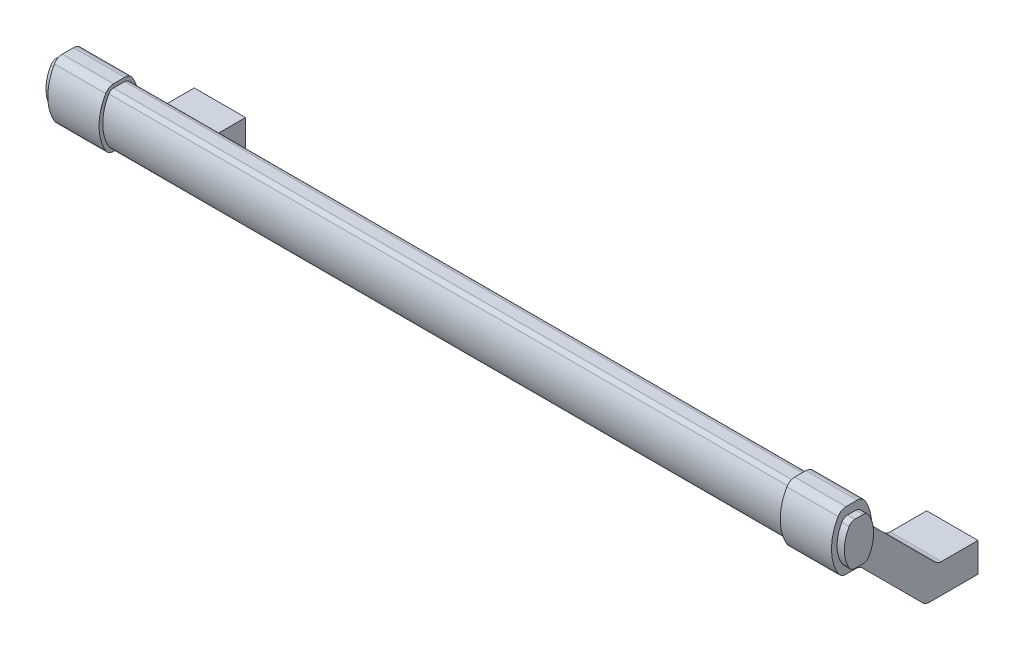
ISO-10303-21;
HEADER;
FILE_DESCRIPTION(('STEP AP214'),'2;1');
FILE_NAME('part.step','',(''),(''),'','','');
FILE_SCHEMA(('AUTOMOTIVE_DESIGN { 1 0 10303 214 1 1 1 1 }'));
ENDSEC;
DATA;
#1=APPLICATION_CONTEXT('core data for automotive mechanical design processes');
#2=APPLICATION_PROTOCOL_DEFINITION('international standard','automotive_design',2000,#1);
#3=PRODUCT_CONTEXT('',#1,'mechanical');
#4=PRODUCT('Part','Part','',(#3));
#5=PRODUCT_RELATED_PRODUCT_CATEGORY('part','',(#4));
#6=PRODUCT_DEFINITION_FORMATION('','',#4);
#7=PRODUCT_DEFINITION_CONTEXT('part definition',#1,'design');
#8=PRODUCT_DEFINITION('design','',#6,#7);
#9=PRODUCT_DEFINITION_SHAPE('','',#8);
#10=(LENGTH_UNIT() NAMED_UNIT(*) SI_UNIT(.MILLI.,.METRE.));
#11=(NAMED_UNIT(*) PLANE_ANGLE_UNIT() SI_UNIT($,.RADIAN.));
#12=(NAMED_UNIT(*) SI_UNIT($,.STERADIAN.) SOLID_ANGLE_UNIT());
#13=UNCERTAINTY_MEASURE_WITH_UNIT(LENGTH_MEASURE(1.E-05),#10,'distance_accuracy_value','');
#14=(GEOMETRIC_REPRESENTATION_CONTEXT(3) GLOBAL_UNCERTAINTY_ASSIGNED_CONTEXT((#13)) GLOBAL_UNIT_ASSIGNED_CONTEXT((#10,
#11,#12)) REPRESENTATION_CONTEXT('',''));
#15=CARTESIAN_POINT('',(0.,0.,0.));
#16=DIRECTION('',(0.,0.,1.));
#17=DIRECTION('',(1.,0.,0.));
#18=AXIS2_PLACEMENT_3D('',#15,#16,#17);
#19=CARTESIAN_POINT('',(-7.,3.6338834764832,0.));
#20=DIRECTION('',(0.,0.,1.));
#21=DIRECTION('',(-1.,0.,0.));
#22=AXIS2_PLACEMENT_3D('',#19,#20,#21);
#23=PLANE('',#22);
#24=CARTESIAN_POINT('',(0.,0.,0.));
#25=DIRECTION('',(0.,0.,-1.));
#26=DIRECTION('',(1.,0.,0.));
#27=AXIS2_PLACEMENT_3D('',#24,#25,#26);
#28=CIRCLE('',#27,2.5);
#29=CARTESIAN_POINT('',(2.5,0.,0.));
#30=VERTEX_POINT('',#29);
#31=EDGE_CURVE('E610',#30,#30,#28,.T.);
#32=ORIENTED_EDGE('',*,*,#31,.F.);
#33=EDGE_LOOP('',(#32));
#34=FACE_BOUND('',#33,.T.);
#35=DIRECTION('',(1.,0.,0.));
#36=VECTOR('',#35,1.);
#37=CARTESIAN_POINT('',(-7.,-4.3661165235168,0.));
#38=LINE('',#37,#36);
#39=CARTESIAN_POINT('',(-7.,-4.3661165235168,0.));
#40=VERTEX_POINT('',#39);
#41=CARTESIAN_POINT('',(7.,-4.3661165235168,0.));
#42=VERTEX_POINT('',#41);
#43=EDGE_CURVE('E9',#40,#42,#38,.T.);
#44=ORIENTED_EDGE('',*,*,#43,.F.);
#45=DIRECTION('',(0.,-1.,0.));
#46=VECTOR('',#45,1.);
#47=CARTESIAN_POINT('',(-7.,3.6338834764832,0.));
#48=LINE('',#47,#46);
#49=CARTESIAN_POINT('',(-7.,3.6338834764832,0.));
#50=VERTEX_POINT('',#49);
#51=EDGE_CURVE('E763',#50,#40,#48,.T.);
#52=ORIENTED_EDGE('',*,*,#51,.F.);
#53=DIRECTION('',(1.,0.,0.));
#54=VECTOR('',#53,1.);
#55=CARTESIAN_POINT('',(-7.,3.6338834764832,0.));
#56=LINE('',#55,#54);
#57=CARTESIAN_POINT('',(7.,3.6338834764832,0.));
#58=VERTEX_POINT('',#57);
#59=EDGE_CURVE('E811',#50,#58,#56,.T.);
#60=ORIENTED_EDGE('',*,*,#59,.T.);
#61=DIRECTION('',(0.,-1.,0.));
#62=VECTOR('',#61,1.);
#63=CARTESIAN_POINT('',(7.,3.6338834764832,0.));
#64=LINE('',#63,#62);
#65=EDGE_CURVE('E715',#58,#42,#64,.T.);
#66=ORIENTED_EDGE('',*,*,#65,.T.);
#67=EDGE_LOOP('',(#44,#52,#60,#66));
#68=FACE_BOUND('',#67,.T.);
#69=ADVANCED_FACE('F14',(#34,#68),#23,.F.);
#70=CARTESIAN_POINT('',(-7.,-4.3661165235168,0.));
#71=DIRECTION('',(0.,1.,0.));
#72=DIRECTION('',(-1.,0.,0.));
#73=AXIS2_PLACEMENT_3D('',#70,#71,#72);
#74=PLANE('',#73);
#75=DIRECTION('',(1.,0.,0.));
#76=VECTOR('',#75,1.);
#77=CARTESIAN_POINT('',(-7.,-4.3661165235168,13.278174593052));
#78=LINE('',#77,#76);
#79=CARTESIAN_POINT('',(-7.,-4.3661165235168,13.278174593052));
#80=VERTEX_POINT('',#79);
#81=CARTESIAN_POINT('',(7.,-4.3661165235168,13.278174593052));
#82=VERTEX_POINT('',#81);
#83=EDGE_CURVE('E22',#80,#82,#78,.T.);
#84=ORIENTED_EDGE('',*,*,#83,.F.);
#85=DIRECTION('',(0.,0.,1.));
#86=VECTOR('',#85,1.);
#87=CARTESIAN_POINT('',(-7.,-4.3661165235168,0.));
#88=LINE('',#87,#86);
#89=EDGE_CURVE('E766',#40,#80,#88,.T.);
#90=ORIENTED_EDGE('',*,*,#89,.F.);
#91=ORIENTED_EDGE('',*,*,#43,.T.);
#92=DIRECTION('',(0.,0.,1.));
#93=VECTOR('',#92,1.);
#94=CARTESIAN_POINT('',(7.,-4.3661165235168,0.));
#95=LINE('',#94,#93);
#96=EDGE_CURVE('E718',#42,#82,#95,.T.);
#97=ORIENTED_EDGE('',*,*,#96,.T.);
#98=EDGE_LOOP('',(#84,#90,#91,#97));
#99=FACE_BOUND('',#98,.T.);
#100=ADVANCED_FACE('F16',(#99),#74,.F.);
#101=CARTESIAN_POINT('',(-7.,-1.86611652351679,13.278174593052));
#102=DIRECTION('',(1.,0.,0.));
#103=DIRECTION('',(0.,1.,0.));
#104=AXIS2_PLACEMENT_3D('',#101,#102,#103);
#105=CYLINDRICAL_SURFACE('',#104,2.49999999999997);
#106=DIRECTION('',(1.,0.,0.));
#107=VECTOR('',#106,1.);
#108=CARTESIAN_POINT('',(-7.,-3.63388347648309,15.0459415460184));
#109=LINE('',#108,#107);
#110=CARTESIAN_POINT('',(-7.,-3.63388347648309,15.0459415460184));
#111=VERTEX_POINT('',#110);
#112=CARTESIAN_POINT('',(7.,-3.63388347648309,15.0459415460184));
#113=VERTEX_POINT('',#112);
#114=EDGE_CURVE('E837',#111,#113,#109,.T.);
#115=ORIENTED_EDGE('',*,*,#114,.F.);
#116=CARTESIAN_POINT('',(-7.,-1.86611652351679,13.278174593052));
#117=DIRECTION('',(-1.,0.,0.));
#118=DIRECTION('',(0.,-1.,0.));
#119=AXIS2_PLACEMENT_3D('',#116,#117,#118);
#120=CIRCLE('',#119,2.49999999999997);
#121=EDGE_CURVE('E769',#80,#111,#120,.T.);
#122=ORIENTED_EDGE('',*,*,#121,.F.);
#123=ORIENTED_EDGE('',*,*,#83,.T.);
#124=CARTESIAN_POINT('',(7.,-1.86611652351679,13.278174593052));
#125=DIRECTION('',(-1.,0.,0.));
#126=DIRECTION('',(0.,-1.,0.));
#127=AXIS2_PLACEMENT_3D('',#124,#125,#126);
#128=CIRCLE('',#127,2.49999999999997);
#129=EDGE_CURVE('E721',#82,#113,#128,.T.);
#130=ORIENTED_EDGE('',*,*,#129,.T.);
#131=EDGE_LOOP('',(#115,#122,#123,#130));
#132=FACE_BOUND('',#131,.T.);
#133=ADVANCED_FACE('F840',(#132),#105,.T.);
#134=CARTESIAN_POINT('',(-7.,12.9016504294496,31.581475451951));
#135=DIRECTION('',(0.,-0.707106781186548,0.707106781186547));
#136=DIRECTION('',(0.,0.707106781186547,0.707106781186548));
#137=AXIS2_PLACEMENT_3D('',#134,#135,#136);
#138=PLANE('',#137);
#139=DIRECTION('',(1.,0.,0.));
#140=VECTOR('',#139,1.);
#141=CARTESIAN_POINT('',(-7.,12.9016504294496,31.581475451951));
#142=LINE('',#141,#140);
#143=CARTESIAN_POINT('',(-7.,12.9016504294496,31.581475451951));
#144=VERTEX_POINT('',#143);
#145=CARTESIAN_POINT('',(7.,12.9016504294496,31.581475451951));
#146=VERTEX_POINT('',#145);
#147=EDGE_CURVE('E835',#144,#146,#142,.T.);
#148=ORIENTED_EDGE('',*,*,#147,.F.);
#149=DIRECTION('',(0.,-0.707106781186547,-0.707106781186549));
#150=VECTOR('',#149,1.);
#151=CARTESIAN_POINT('',(-7.,12.9016504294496,31.581475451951));
#152=LINE('',#151,#150);
#153=EDGE_CURVE('E772',#144,#111,#152,.T.);
#154=ORIENTED_EDGE('',*,*,#153,.T.);
#155=ORIENTED_EDGE('',*,*,#114,.T.);
#156=DIRECTION('',(0.,-0.707106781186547,-0.707106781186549));
#157=VECTOR('',#156,1.);
#158=CARTESIAN_POINT('',(7.,12.9016504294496,31.581475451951));
#159=LINE('',#158,#157);
#160=EDGE_CURVE('E724',#146,#113,#159,.T.);
#161=ORIENTED_EDGE('',*,*,#160,.F.);
#162=EDGE_LOOP('',(#148,#154,#155,#161));
#163=FACE_BOUND('',#162,.T.);
#164=ADVANCED_FACE('F852',(#163),#138,.T.);
#165=CARTESIAN_POINT('',(-7.,11.1338834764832,33.3492424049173));
#166=DIRECTION('',(1.,0.,0.));
#167=DIRECTION('',(0.,1.,0.));
#168=AXIS2_PLACEMENT_3D('',#165,#166,#167);
#169=CYLINDRICAL_SURFACE('',#168,2.5);
#170=DIRECTION('',(1.,0.,0.));
#171=VECTOR('',#170,1.);
#172=CARTESIAN_POINT('',(-7.,13.6338834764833,33.3492424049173));
#173=LINE('',#172,#171);
#174=CARTESIAN_POINT('',(-7.,13.6338834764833,33.3492424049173));
#175=VERTEX_POINT('',#174);
#176=CARTESIAN_POINT('',(7.,13.6338834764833,33.3492424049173));
#177=VERTEX_POINT('',#176);
#178=EDGE_CURVE('E833',#175,#177,#173,.T.);
#179=ORIENTED_EDGE('',*,*,#178,.F.);
#180=CARTESIAN_POINT('',(-7.,11.1338834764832,33.3492424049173));
#181=DIRECTION('',(-1.,0.,0.));
#182=DIRECTION('',(0.,-1.,0.));
#183=AXIS2_PLACEMENT_3D('',#180,#181,#182);
#184=CIRCLE('',#183,2.5);
#185=EDGE_CURVE('E775',#175,#144,#184,.T.);
#186=ORIENTED_EDGE('',*,*,#185,.T.);
#187=ORIENTED_EDGE('',*,*,#147,.T.);
#188=CARTESIAN_POINT('',(7.,11.1338834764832,33.3492424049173));
#189=DIRECTION('',(-1.,0.,0.));
#190=DIRECTION('',(0.,-1.,0.));
#191=AXIS2_PLACEMENT_3D('',#188,#189,#190);
#192=CIRCLE('',#191,2.5);
#193=EDGE_CURVE('E727',#177,#146,#192,.T.);
#194=ORIENTED_EDGE('',*,*,#193,.F.);
#195=EDGE_LOOP('',(#179,#186,#187,#194));
#196=FACE_BOUND('',#195,.T.);
#197=ADVANCED_FACE('F903',(#196),#169,.F.);
#198=CARTESIAN_POINT('',(-7.,13.6338834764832,33.3492424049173));
#199=DIRECTION('',(0.,1.,0.));
#200=DIRECTION('',(-1.,0.,0.));
#201=AXIS2_PLACEMENT_3D('',#198,#199,#200);
#202=PLANE('',#201);
#203=DIRECTION('',(1.,0.,0.));
#204=VECTOR('',#203,1.);
#205=CARTESIAN_POINT('',(-7.,13.6338834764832,36.0262794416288));
#206=LINE('',#205,#204);
#207=CARTESIAN_POINT('',(-7.,13.6338834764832,36.0262794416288));
#208=VERTEX_POINT('',#207);
#209=CARTESIAN_POINT('',(7.,13.6338834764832,36.0262794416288));
#210=VERTEX_POINT('',#209);
#211=EDGE_CURVE('E831',#208,#210,#206,.T.);
#212=ORIENTED_EDGE('',*,*,#211,.F.);
#213=DIRECTION('',(0.,0.,1.));
#214=VECTOR('',#213,1.);
#215=CARTESIAN_POINT('',(-7.,13.6338834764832,33.3492424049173));
#216=LINE('',#215,#214);
#217=EDGE_CURVE('E778',#175,#208,#216,.T.);
#218=ORIENTED_EDGE('',*,*,#217,.F.);
#219=ORIENTED_EDGE('',*,*,#178,.T.);
#220=DIRECTION('',(0.,0.,1.));
#221=VECTOR('',#220,1.);
#222=CARTESIAN_POINT('',(7.,13.6338834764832,33.3492424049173));
#223=LINE('',#222,#221);
#224=EDGE_CURVE('E730',#177,#210,#223,.T.);
#225=ORIENTED_EDGE('',*,*,#224,.T.);
#226=EDGE_LOOP('',(#212,#218,#219,#225));
#227=FACE_BOUND('',#226,.T.);
#228=ADVANCED_FACE('F901',(#227),#202,.F.);
#229=CARTESIAN_POINT('',(-7.,16.1338834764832,36.0262794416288));
#230=DIRECTION('',(1.,0.,0.));
#231=DIRECTION('',(0.,1.,0.));
#232=AXIS2_PLACEMENT_3D('',#229,#230,#231);
#233=CYLINDRICAL_SURFACE('',#232,2.5);
#234=DIRECTION('',(1.,0.,0.));
#235=VECTOR('',#234,1.);
#236=CARTESIAN_POINT('',(-7.,14.8838834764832,38.1913429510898));
#237=LINE('',#236,#235);
#238=CARTESIAN_POINT('',(-7.,14.8838834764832,38.1913429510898));
#239=VERTEX_POINT('',#238);
#240=CARTESIAN_POINT('',(7.,14.8838834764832,38.1913429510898));
#241=VERTEX_POINT('',#240);
#242=EDGE_CURVE('E829',#239,#241,#237,.T.);
#243=ORIENTED_EDGE('',*,*,#242,.F.);
#244=CARTESIAN_POINT('',(-7.,16.1338834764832,36.0262794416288));
#245=DIRECTION('',(-1.,0.,0.));
#246=DIRECTION('',(0.,-1.,0.));
#247=AXIS2_PLACEMENT_3D('',#244,#245,#246);
#248=CIRCLE('',#247,2.5);
#249=EDGE_CURVE('E781',#208,#239,#248,.T.);
#250=ORIENTED_EDGE('',*,*,#249,.F.);
#251=ORIENTED_EDGE('',*,*,#211,.T.);
#252=CARTESIAN_POINT('',(7.,16.1338834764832,36.0262794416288));
#253=DIRECTION('',(-1.,0.,0.));
#254=DIRECTION('',(0.,-1.,0.));
#255=AXIS2_PLACEMENT_3D('',#252,#253,#254);
#256=CIRCLE('',#255,2.5);
#257=EDGE_CURVE('E733',#210,#241,#256,.T.);
#258=ORIENTED_EDGE('',*,*,#257,.T.);
#259=EDGE_LOOP('',(#243,#250,#251,#258));
#260=FACE_BOUND('',#259,.T.);
#261=ADVANCED_FACE('F898',(#260),#233,.T.);
#262=CARTESIAN_POINT('',(-7.,21.6338834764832,26.5));
#263=DIRECTION('',(1.,0.,0.));
#264=DIRECTION('',(0.,1.,0.));
#265=AXIS2_PLACEMENT_3D('',#262,#263,#264);
#266=CYLINDRICAL_SURFACE('',#265,13.5);
#267=DIRECTION('',(1.,0.,0.));
#268=VECTOR('',#267,1.);
#269=CARTESIAN_POINT('',(-7.,28.3838834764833,38.1913429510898));
#270=LINE('',#269,#268);
#271=CARTESIAN_POINT('',(-7.,28.3838834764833,38.1913429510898));
#272=VERTEX_POINT('',#271);
#273=CARTESIAN_POINT('',(7.,28.3838834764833,38.1913429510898));
#274=VERTEX_POINT('',#273);
#275=EDGE_CURVE('E827',#272,#274,#270,.T.);
#276=ORIENTED_EDGE('',*,*,#275,.F.);
#277=CARTESIAN_POINT('',(-7.,21.6338834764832,26.5));
#278=DIRECTION('',(-1.,0.,0.));
#279=DIRECTION('',(0.,-1.,0.));
#280=AXIS2_PLACEMENT_3D('',#277,#278,#279);
#281=CIRCLE('',#280,13.5);
#282=EDGE_CURVE('E784',#239,#272,#281,.T.);
#283=ORIENTED_EDGE('',*,*,#282,.F.);
#284=ORIENTED_EDGE('',*,*,#242,.T.);
#285=CARTESIAN_POINT('',(7.,21.6338834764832,26.5));
#286=DIRECTION('',(-1.,0.,0.));
#287=DIRECTION('',(0.,-1.,0.));
#288=AXIS2_PLACEMENT_3D('',#285,#286,#287);
#289=CIRCLE('',#288,13.5);
#290=EDGE_CURVE('E736',#241,#274,#289,.T.);
#291=ORIENTED_EDGE('',*,*,#290,.T.);
#292=EDGE_LOOP('',(#276,#283,#284,#291));
#293=FACE_BOUND('',#292,.T.);
#294=ADVANCED_FACE('F894',(#293),#266,.T.);
#295=CARTESIAN_POINT('',(-7.,27.1338834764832,36.0262794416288));
#296=DIRECTION('',(1.,0.,0.));
#297=DIRECTION('',(0.,1.,0.));
#298=AXIS2_PLACEMENT_3D('',#295,#296,#297);
#299=CYLINDRICAL_SURFACE('',#298,2.5);
#300=DIRECTION('',(1.,0.,0.));
#301=VECTOR('',#300,1.);
#302=CARTESIAN_POINT('',(-7.,29.6338834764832,36.0262794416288));
#303=LINE('',#302,#301);
#304=CARTESIAN_POINT('',(-7.,29.6338834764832,36.0262794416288));
#305=VERTEX_POINT('',#304);
#306=CARTESIAN_POINT('',(7.,29.6338834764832,36.0262794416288));
#307=VERTEX_POINT('',#306);
#308=EDGE_CURVE('E825',#305,#307,#303,.T.);
#309=ORIENTED_EDGE('',*,*,#308,.F.);
#310=CARTESIAN_POINT('',(-7.,27.1338834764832,36.0262794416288));
#311=DIRECTION('',(-1.,0.,0.));
#312=DIRECTION('',(0.,-1.,0.));
#313=AXIS2_PLACEMENT_3D('',#310,#311,#312);
#314=CIRCLE('',#313,2.5);
#315=EDGE_CURVE('E787',#272,#305,#314,.T.);
#316=ORIENTED_EDGE('',*,*,#315,.F.);
#317=ORIENTED_EDGE('',*,*,#275,.T.);
#318=CARTESIAN_POINT('',(7.,27.1338834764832,36.0262794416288));
#319=DIRECTION('',(-1.,0.,0.));
#320=DIRECTION('',(0.,-1.,0.));
#321=AXIS2_PLACEMENT_3D('',#318,#319,#320);
#322=CIRCLE('',#321,2.5);
#323=EDGE_CURVE('E739',#274,#307,#322,.T.);
#324=ORIENTED_EDGE('',*,*,#323,.T.);
#325=EDGE_LOOP('',(#309,#316,#317,#324));
#326=FACE_BOUND('',#325,.T.);
#327=ADVANCED_FACE('F890',(#326),#299,.T.);
#328=CARTESIAN_POINT('',(-7.,29.6338834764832,32.9737205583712));
#329=DIRECTION('',(0.,1.,0.));
#330=DIRECTION('',(-1.,0.,0.));
#331=AXIS2_PLACEMENT_3D('',#328,#329,#330);
#332=PLANE('',#331);
#333=DIRECTION('',(1.,0.,0.));
#334=VECTOR('',#333,1.);
#335=CARTESIAN_POINT('',(-7.,29.6338834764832,32.9737205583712));
#336=LINE('',#335,#334);
#337=CARTESIAN_POINT('',(-7.,29.6338834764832,32.9737205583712));
#338=VERTEX_POINT('',#337);
#339=CARTESIAN_POINT('',(7.,29.6338834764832,32.9737205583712));
#340=VERTEX_POINT('',#339);
#341=EDGE_CURVE('E823',#338,#340,#336,.T.);
#342=ORIENTED_EDGE('',*,*,#341,.F.);
#343=DIRECTION('',(0.,0.,1.));
#344=VECTOR('',#343,1.);
#345=CARTESIAN_POINT('',(-7.,29.6338834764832,32.9737205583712));
#346=LINE('',#345,#344);
#347=EDGE_CURVE('E790',#338,#305,#346,.T.);
#348=ORIENTED_EDGE('',*,*,#347,.T.);
#349=ORIENTED_EDGE('',*,*,#308,.T.);
#350=DIRECTION('',(0.,0.,1.));
#351=VECTOR('',#350,1.);
#352=CARTESIAN_POINT('',(7.,29.6338834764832,32.9737205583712));
#353=LINE('',#352,#351);
#354=EDGE_CURVE('E742',#340,#307,#353,.T.);
#355=ORIENTED_EDGE('',*,*,#354,.F.);
#356=EDGE_LOOP('',(#342,#348,#349,#355));
#357=FACE_BOUND('',#356,.T.);
#358=ADVANCED_FACE('F887',(#357),#332,.T.);
#359=CARTESIAN_POINT('',(-7.,27.1338834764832,32.9737205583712));
#360=DIRECTION('',(1.,0.,0.));
#361=DIRECTION('',(0.,1.,0.));
#362=AXIS2_PLACEMENT_3D('',#359,#360,#361);
#363=CYLINDRICAL_SURFACE('',#362,2.5);
#364=DIRECTION('',(1.,0.,0.));
#365=VECTOR('',#364,1.);
#366=CARTESIAN_POINT('',(-7.,28.3838834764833,30.80865704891));
#367=LINE('',#366,#365);
#368=CARTESIAN_POINT('',(-7.,28.3838834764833,30.80865704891));
#369=VERTEX_POINT('',#368);
#370=CARTESIAN_POINT('',(7.,28.3838834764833,30.80865704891));
#371=VERTEX_POINT('',#370);
#372=EDGE_CURVE('E821',#369,#371,#367,.T.);
#373=ORIENTED_EDGE('',*,*,#372,.F.);
#374=CARTESIAN_POINT('',(-7.,27.1338834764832,32.9737205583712));
#375=DIRECTION('',(-1.,0.,0.));
#376=DIRECTION('',(0.,-1.,0.));
#377=AXIS2_PLACEMENT_3D('',#374,#375,#376);
#378=CIRCLE('',#377,2.5);
#379=EDGE_CURVE('E793',#338,#369,#378,.T.);
#380=ORIENTED_EDGE('',*,*,#379,.F.);
#381=ORIENTED_EDGE('',*,*,#341,.T.);
#382=CARTESIAN_POINT('',(7.,27.1338834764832,32.9737205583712));
#383=DIRECTION('',(-1.,0.,0.));
#384=DIRECTION('',(0.,-1.,0.));
#385=AXIS2_PLACEMENT_3D('',#382,#383,#384);
#386=CIRCLE('',#385,2.5);
#387=EDGE_CURVE('E745',#340,#371,#386,.T.);
#388=ORIENTED_EDGE('',*,*,#387,.T.);
#389=EDGE_LOOP('',(#373,#380,#381,#388));
#390=FACE_BOUND('',#389,.T.);
#391=ADVANCED_FACE('F883',(#390),#363,.T.);
#392=CARTESIAN_POINT('',(-7.,21.6338834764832,42.5));
#393=DIRECTION('',(1.,0.,0.));
#394=DIRECTION('',(0.,1.,0.));
#395=AXIS2_PLACEMENT_3D('',#392,#393,#394);
#396=CYLINDRICAL_SURFACE('',#395,13.5);
#397=DIRECTION('',(1.,0.,0.));
#398=VECTOR('',#397,1.);
#399=CARTESIAN_POINT('',(-7.,22.5379188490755,29.0303036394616));
#400=LINE('',#399,#398);
#401=CARTESIAN_POINT('',(-7.,22.5379188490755,29.0303036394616));
#402=VERTEX_POINT('',#401);
#403=CARTESIAN_POINT('',(7.,22.5379188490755,29.0303036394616));
#404=VERTEX_POINT('',#403);
#405=EDGE_CURVE('E819',#402,#404,#400,.T.);
#406=ORIENTED_EDGE('',*,*,#405,.F.);
#407=CARTESIAN_POINT('',(-7.,21.6338834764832,42.5));
#408=DIRECTION('',(-1.,0.,0.));
#409=DIRECTION('',(0.,-1.,0.));
#410=AXIS2_PLACEMENT_3D('',#407,#408,#409);
#411=CIRCLE('',#410,13.5);
#412=EDGE_CURVE('E796',#369,#402,#411,.T.);
#413=ORIENTED_EDGE('',*,*,#412,.F.);
#414=ORIENTED_EDGE('',*,*,#372,.T.);
#415=CARTESIAN_POINT('',(7.,21.6338834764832,42.5));
#416=DIRECTION('',(-1.,0.,0.));
#417=DIRECTION('',(0.,-1.,0.));
#418=AXIS2_PLACEMENT_3D('',#415,#416,#417);
#419=CIRCLE('',#418,13.5);
#420=EDGE_CURVE('E748',#371,#404,#419,.T.);
#421=ORIENTED_EDGE('',*,*,#420,.T.);
#422=EDGE_LOOP('',(#406,#413,#414,#421));
#423=FACE_BOUND('',#422,.T.);
#424=ADVANCED_FACE('F878',(#423),#396,.T.);
#425=CARTESIAN_POINT('',(-7.,22.705332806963,26.535915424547));
#426=DIRECTION('',(1.,0.,0.));
#427=DIRECTION('',(0.,1.,0.));
#428=AXIS2_PLACEMENT_3D('',#425,#426,#427);
#429=CYLINDRICAL_SURFACE('',#428,2.5);
#430=DIRECTION('',(1.,0.,0.));
#431=VECTOR('',#430,1.);
#432=CARTESIAN_POINT('',(-7.,20.9375658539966,28.3036823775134));
#433=LINE('',#432,#431);
#434=CARTESIAN_POINT('',(-7.,20.9375658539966,28.3036823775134));
#435=VERTEX_POINT('',#434);
#436=CARTESIAN_POINT('',(7.,20.9375658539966,28.3036823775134));
#437=VERTEX_POINT('',#436);
#438=EDGE_CURVE('E817',#435,#437,#433,.T.);
#439=ORIENTED_EDGE('',*,*,#438,.F.);
#440=CARTESIAN_POINT('',(-7.,22.705332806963,26.535915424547));
#441=DIRECTION('',(-1.,0.,0.));
#442=DIRECTION('',(0.,-1.,0.));
#443=AXIS2_PLACEMENT_3D('',#440,#441,#442);
#444=CIRCLE('',#443,2.5);
#445=EDGE_CURVE('E799',#435,#402,#444,.T.);
#446=ORIENTED_EDGE('',*,*,#445,.T.);
#447=ORIENTED_EDGE('',*,*,#405,.T.);
#448=CARTESIAN_POINT('',(7.,22.705332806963,26.535915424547));
#449=DIRECTION('',(-1.,0.,0.));
#450=DIRECTION('',(0.,-1.,0.));
#451=AXIS2_PLACEMENT_3D('',#448,#449,#450);
#452=CIRCLE('',#451,2.5);
#453=EDGE_CURVE('E751',#437,#404,#452,.T.);
#454=ORIENTED_EDGE('',*,*,#453,.F.);
#455=EDGE_LOOP('',(#439,#446,#447,#454));
#456=FACE_BOUND('',#455,.T.);
#457=ADVANCED_FACE('F875',(#456),#429,.F.);
#458=CARTESIAN_POINT('',(-7.,20.9375658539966,28.3036823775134));
#459=DIRECTION('',(0.,-0.707106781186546,0.707106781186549));
#460=DIRECTION('',(0.,0.707106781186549,0.707106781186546));
#461=AXIS2_PLACEMENT_3D('',#458,#459,#460);
#462=PLANE('',#461);
#463=DIRECTION('',(1.,0.,0.));
#464=VECTOR('',#463,1.);
#465=CARTESIAN_POINT('',(-7.,4.3661165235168,11.7322330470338));
#466=LINE('',#465,#464);
#467=CARTESIAN_POINT('',(-7.,4.3661165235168,11.7322330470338));
#468=VERTEX_POINT('',#467);
#469=CARTESIAN_POINT('',(7.,4.3661165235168,11.7322330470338));
#470=VERTEX_POINT('',#469);
#471=EDGE_CURVE('E815',#468,#470,#466,.T.);
#472=ORIENTED_EDGE('',*,*,#471,.F.);
#473=DIRECTION('',(0.,-0.707106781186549,-0.707106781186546));
#474=VECTOR('',#473,1.);
#475=CARTESIAN_POINT('',(-7.,20.9375658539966,28.3036823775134));
#476=LINE('',#475,#474);
#477=EDGE_CURVE('E802',#435,#468,#476,.T.);
#478=ORIENTED_EDGE('',*,*,#477,.F.);
#479=ORIENTED_EDGE('',*,*,#438,.T.);
#480=DIRECTION('',(0.,-0.707106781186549,-0.707106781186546));
#481=VECTOR('',#480,1.);
#482=CARTESIAN_POINT('',(7.,20.9375658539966,28.3036823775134));
#483=LINE('',#482,#481);
#484=EDGE_CURVE('E754',#437,#470,#483,.T.);
#485=ORIENTED_EDGE('',*,*,#484,.T.);
#486=EDGE_LOOP('',(#472,#478,#479,#485));
#487=FACE_BOUND('',#486,.T.);
#488=ADVANCED_FACE('F871',(#487),#462,.F.);
#489=CARTESIAN_POINT('',(-7.,6.13388347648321,9.9644660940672));
#490=DIRECTION('',(1.,0.,0.));
#491=DIRECTION('',(0.,1.,0.));
#492=AXIS2_PLACEMENT_3D('',#489,#490,#491);
#493=CYLINDRICAL_SURFACE('',#492,2.5);
#494=DIRECTION('',(1.,0.,0.));
#495=VECTOR('',#494,1.);
#496=CARTESIAN_POINT('',(-7.,3.6338834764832,9.9644660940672));
#497=LINE('',#496,#495);
#498=CARTESIAN_POINT('',(-7.,3.6338834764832,9.9644660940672));
#499=VERTEX_POINT('',#498);
#500=CARTESIAN_POINT('',(7.,3.6338834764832,9.9644660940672));
#501=VERTEX_POINT('',#500);
#502=EDGE_CURVE('E813',#499,#501,#497,.T.);
#503=ORIENTED_EDGE('',*,*,#502,.F.);
#504=CARTESIAN_POINT('',(-7.,6.13388347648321,9.9644660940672));
#505=DIRECTION('',(-1.,0.,0.));
#506=DIRECTION('',(0.,-1.,0.));
#507=AXIS2_PLACEMENT_3D('',#504,#505,#506);
#508=CIRCLE('',#507,2.5);
#509=EDGE_CURVE('E805',#499,#468,#508,.T.);
#510=ORIENTED_EDGE('',*,*,#509,.T.);
#511=ORIENTED_EDGE('',*,*,#471,.T.);
#512=CARTESIAN_POINT('',(7.,6.13388347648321,9.9644660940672));
#513=DIRECTION('',(-1.,0.,0.));
#514=DIRECTION('',(0.,-1.,0.));
#515=AXIS2_PLACEMENT_3D('',#512,#513,#514);
#516=CIRCLE('',#515,2.5);
#517=EDGE_CURVE('E757',#501,#470,#516,.T.);
#518=ORIENTED_EDGE('',*,*,#517,.F.);
#519=EDGE_LOOP('',(#503,#510,#511,#518));
#520=FACE_BOUND('',#519,.T.);
#521=ADVANCED_FACE('F866',(#520),#493,.F.);
#522=CARTESIAN_POINT('',(-7.,3.6338834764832,0.));
#523=DIRECTION('',(0.,1.,0.));
#524=DIRECTION('',(-1.,0.,0.));
#525=AXIS2_PLACEMENT_3D('',#522,#523,#524);
#526=PLANE('',#525);
#527=DIRECTION('',(0.,0.,1.));
#528=VECTOR('',#527,1.);
#529=CARTESIAN_POINT('',(-7.,3.6338834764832,0.));
#530=LINE('',#529,#528);
#531=EDGE_CURVE('E808',#50,#499,#530,.T.);
#532=ORIENTED_EDGE('',*,*,#531,.T.);
#533=ORIENTED_EDGE('',*,*,#502,.T.);
#534=DIRECTION('',(0.,0.,1.));
#535=VECTOR('',#534,1.);
#536=CARTESIAN_POINT('',(7.,3.6338834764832,0.));
#537=LINE('',#536,#535);
#538=EDGE_CURVE('E760',#58,#501,#537,.T.);
#539=ORIENTED_EDGE('',*,*,#538,.F.);
#540=ORIENTED_EDGE('',*,*,#59,.F.);
#541=EDGE_LOOP('',(#532,#533,#539,#540));
#542=FACE_BOUND('',#541,.T.);
#543=ADVANCED_FACE('F863',(#542),#526,.T.);
#544=CARTESIAN_POINT('',(-7.,-1.86611652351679,13.278174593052));
#545=DIRECTION('',(-1.,0.,0.));
#546=DIRECTION('',(0.,-1.,0.));
#547=AXIS2_PLACEMENT_3D('',#544,#545,#546);
#548=PLANE('',#547);
#549=CARTESIAN_POINT('',(-7.,17.6338834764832,35.6100214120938));
#550=DIRECTION('',(-1.,0.,0.));
#551=DIRECTION('',(0.,-1.,0.));
#552=AXIS2_PLACEMENT_3D('',#549,#550,#551);
#553=CIRCLE('',#552,1.81818181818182);
#554=CARTESIAN_POINT('',(-7.,15.8157016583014,35.6100214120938));
#555=VERTEX_POINT('',#554);
#556=CARTESIAN_POINT('',(-7.,16.7247925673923,37.1846130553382));
#557=VERTEX_POINT('',#556);
#558=EDGE_CURVE('E37',#555,#557,#553,.T.);
#559=ORIENTED_EDGE('',*,*,#558,.F.);
#560=DIRECTION('',(0.,0.,1.));
#561=VECTOR('',#560,1.);
#562=CARTESIAN_POINT('',(-7.,15.8157016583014,33.3899785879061));
#563=LINE('',#562,#561);
#564=CARTESIAN_POINT('',(-7.,15.8157016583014,33.3899785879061));
#565=VERTEX_POINT('',#564);
#566=EDGE_CURVE('E665',#565,#555,#563,.T.);
#567=ORIENTED_EDGE('',*,*,#566,.F.);
#568=CARTESIAN_POINT('',(-7.,17.6338834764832,33.3899785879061));
#569=DIRECTION('',(-1.,0.,0.));
#570=DIRECTION('',(0.,-1.,0.));
#571=AXIS2_PLACEMENT_3D('',#568,#569,#570);
#572=CIRCLE('',#571,1.81818181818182);
#573=CARTESIAN_POINT('',(-7.,16.7247925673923,31.8153869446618));
#574=VERTEX_POINT('',#573);
#575=EDGE_CURVE('E662',#574,#565,#572,.T.);
#576=ORIENTED_EDGE('',*,*,#575,.F.);
#577=CARTESIAN_POINT('',(-7.,21.6338834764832,40.3181818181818));
#578=DIRECTION('',(-1.,0.,0.));
#579=DIRECTION('',(0.,-1.,0.));
#580=AXIS2_PLACEMENT_3D('',#577,#578,#579);
#581=CIRCLE('',#580,9.81818181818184);
#582=CARTESIAN_POINT('',(-7.,26.5429743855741,31.8153869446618));
#583=VERTEX_POINT('',#582);
#584=EDGE_CURVE('E659',#583,#574,#581,.T.);
#585=ORIENTED_EDGE('',*,*,#584,.F.);
#586=CARTESIAN_POINT('',(-7.,25.6338834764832,33.3899785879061));
#587=DIRECTION('',(-1.,0.,0.));
#588=DIRECTION('',(0.,-1.,0.));
#589=AXIS2_PLACEMENT_3D('',#586,#587,#588);
#590=CIRCLE('',#589,1.81818181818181);
#591=CARTESIAN_POINT('',(-7.,27.4520652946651,33.3899785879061));
#592=VERTEX_POINT('',#591);
#593=EDGE_CURVE('E656',#592,#583,#590,.T.);
#594=ORIENTED_EDGE('',*,*,#593,.F.);
#595=DIRECTION('',(0.,0.,1.));
#596=VECTOR('',#595,1.);
#597=CARTESIAN_POINT('',(-7.,27.4520652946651,33.3899785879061));
#598=LINE('',#597,#596);
#599=CARTESIAN_POINT('',(-7.,27.4520652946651,35.6100214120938));
#600=VERTEX_POINT('',#599);
#601=EDGE_CURVE('E654',#592,#600,#598,.T.);
#602=ORIENTED_EDGE('',*,*,#601,.T.);
#603=CARTESIAN_POINT('',(-7.,25.6338834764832,35.6100214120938));
#604=DIRECTION('',(-1.,0.,0.));
#605=DIRECTION('',(0.,-1.,0.));
#606=AXIS2_PLACEMENT_3D('',#603,#604,#605);
#607=CIRCLE('',#606,1.81818181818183);
#608=CARTESIAN_POINT('',(-7.,26.5429743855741,37.1846130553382));
#609=VERTEX_POINT('',#608);
#610=EDGE_CURVE('E651',#609,#600,#607,.T.);
#611=ORIENTED_EDGE('',*,*,#610,.F.);
#612=CARTESIAN_POINT('',(-7.,21.6338834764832,28.6818181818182));
#613=DIRECTION('',(-1.,0.,0.));
#614=DIRECTION('',(0.,-1.,0.));
#615=AXIS2_PLACEMENT_3D('',#612,#613,#614);
#616=CIRCLE('',#615,9.81818181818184);
#617=EDGE_CURVE('E648',#557,#609,#616,.T.);
#618=ORIENTED_EDGE('',*,*,#617,.F.);
#619=EDGE_LOOP('',(#559,#567,#576,#585,#594,#602,#611,#618));
#620=FACE_BOUND('',#619,.T.);
#621=ORIENTED_EDGE('',*,*,#51,.T.);
#622=ORIENTED_EDGE('',*,*,#89,.T.);
#623=ORIENTED_EDGE('',*,*,#121,.T.);
#624=ORIENTED_EDGE('',*,*,#153,.F.);
#625=ORIENTED_EDGE('',*,*,#185,.F.);
#626=ORIENTED_EDGE('',*,*,#217,.T.);
#627=ORIENTED_EDGE('',*,*,#249,.T.);
#628=ORIENTED_EDGE('',*,*,#282,.T.);
#629=ORIENTED_EDGE('',*,*,#315,.T.);
#630=ORIENTED_EDGE('',*,*,#347,.F.);
#631=ORIENTED_EDGE('',*,*,#379,.T.);
#632=ORIENTED_EDGE('',*,*,#412,.T.);
#633=ORIENTED_EDGE('',*,*,#445,.F.);
#634=ORIENTED_EDGE('',*,*,#477,.T.);
#635=ORIENTED_EDGE('',*,*,#509,.F.);
#636=ORIENTED_EDGE('',*,*,#531,.F.);
#637=EDGE_LOOP('',(#621,#622,#623,#624,#625,#626,#627,#628,#629,#630,#631,#632,#633,#634,#635,#636));
#638=FACE_BOUND('',#637,.T.);
#639=ADVANCED_FACE('F855',(#620,#638),#548,.T.);
#640=CARTESIAN_POINT('',(7.,-1.86611652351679,13.278174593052));
#641=DIRECTION('',(-1.,0.,0.));
#642=DIRECTION('',(0.,-1.,0.));
#643=AXIS2_PLACEMENT_3D('',#640,#641,#642);
#644=PLANE('',#643);
#645=CARTESIAN_POINT('',(7.,27.1338834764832,32.973720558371));
#646=DIRECTION('',(-1.,0.,0.));
#647=DIRECTION('',(0.,-1.,0.));
#648=AXIS2_PLACEMENT_3D('',#645,#646,#647);
#649=CIRCLE('',#648,1.5);
#650=CARTESIAN_POINT('',(7.,28.6338834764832,32.9737205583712));
#651=VERTEX_POINT('',#650);
#652=CARTESIAN_POINT('',(7.,27.8838834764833,31.6746824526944));
#653=VERTEX_POINT('',#652);
#654=EDGE_CURVE('E374',#651,#653,#649,.T.);
#655=ORIENTED_EDGE('',*,*,#654,.T.);
#656=CARTESIAN_POINT('',(7.,21.6338834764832,42.5));
#657=DIRECTION('',(-1.,0.,0.));
#658=DIRECTION('',(0.,-1.,0.));
#659=AXIS2_PLACEMENT_3D('',#656,#657,#658);
#660=CIRCLE('',#659,12.5);
#661=CARTESIAN_POINT('',(7.,15.3838834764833,31.6746824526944));
#662=VERTEX_POINT('',#661);
#663=EDGE_CURVE('E29',#653,#662,#660,.T.);
#664=ORIENTED_EDGE('',*,*,#663,.T.);
#665=CARTESIAN_POINT('',(7.,16.1338834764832,32.973720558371));
#666=DIRECTION('',(-1.,0.,0.));
#667=DIRECTION('',(0.,-1.,0.));
#668=AXIS2_PLACEMENT_3D('',#665,#666,#667);
#669=CIRCLE('',#668,1.49999999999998);
#670=CARTESIAN_POINT('',(7.,14.6338834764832,32.973720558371));
#671=VERTEX_POINT('',#670);
#672=EDGE_CURVE('E371',#662,#671,#669,.T.);
#673=ORIENTED_EDGE('',*,*,#672,.T.);
#674=DIRECTION('',(0.,0.,1.));
#675=VECTOR('',#674,1.);
#676=CARTESIAN_POINT('',(7.,14.6338834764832,32.973720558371));
#677=LINE('',#676,#675);
#678=CARTESIAN_POINT('',(7.,14.6338834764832,36.0262794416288));
#679=VERTEX_POINT('',#678);
#680=EDGE_CURVE('E618',#671,#679,#677,.T.);
#681=ORIENTED_EDGE('',*,*,#680,.T.);
#682=CARTESIAN_POINT('',(7.,16.1338834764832,36.0262794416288));
#683=DIRECTION('',(1.,0.,0.));
#684=DIRECTION('',(0.,1.,0.));
#685=AXIS2_PLACEMENT_3D('',#682,#683,#684);
#686=CIRCLE('',#685,1.49999999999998);
#687=CARTESIAN_POINT('',(7.,15.3838834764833,37.3253175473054));
#688=VERTEX_POINT('',#687);
#689=EDGE_CURVE('E621',#688,#679,#686,.T.);
#690=ORIENTED_EDGE('',*,*,#689,.F.);
#691=CARTESIAN_POINT('',(7.,21.6338834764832,26.5));
#692=DIRECTION('',(1.,0.,0.));
#693=DIRECTION('',(0.,1.,0.));
#694=AXIS2_PLACEMENT_3D('',#691,#692,#693);
#695=CIRCLE('',#694,12.5);
#696=CARTESIAN_POINT('',(7.,27.8838834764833,37.3253175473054));
#697=VERTEX_POINT('',#696);
#698=EDGE_CURVE('E624',#697,#688,#695,.T.);
#699=ORIENTED_EDGE('',*,*,#698,.F.);
#700=CARTESIAN_POINT('',(7.,27.1338834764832,36.0262794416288));
#701=DIRECTION('',(1.,0.,0.));
#702=DIRECTION('',(0.,1.,0.));
#703=AXIS2_PLACEMENT_3D('',#700,#701,#702);
#704=CIRCLE('',#703,1.5);
#705=CARTESIAN_POINT('',(7.,28.6338834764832,36.0262794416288));
#706=VERTEX_POINT('',#705);
#707=EDGE_CURVE('E627',#706,#697,#704,.T.);
#708=ORIENTED_EDGE('',*,*,#707,.F.);
#709=DIRECTION('',(0.,0.,1.));
#710=VECTOR('',#709,1.);
#711=CARTESIAN_POINT('',(7.,28.6338834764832,32.9737205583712));
#712=LINE('',#711,#710);
#713=EDGE_CURVE('E630',#651,#706,#712,.T.);
#714=ORIENTED_EDGE('',*,*,#713,.F.);
#715=EDGE_LOOP('',(#655,#664,#673,#681,#690,#699,#708,#714));
#716=FACE_BOUND('',#715,.T.);
#717=ORIENTED_EDGE('',*,*,#65,.F.);
#718=ORIENTED_EDGE('',*,*,#538,.T.);
#719=ORIENTED_EDGE('',*,*,#517,.T.);
#720=ORIENTED_EDGE('',*,*,#484,.F.);
#721=ORIENTED_EDGE('',*,*,#453,.T.);
#722=ORIENTED_EDGE('',*,*,#420,.F.);
#723=ORIENTED_EDGE('',*,*,#387,.F.);
#724=ORIENTED_EDGE('',*,*,#354,.T.);
#725=ORIENTED_EDGE('',*,*,#323,.F.);
#726=ORIENTED_EDGE('',*,*,#290,.F.);
#727=ORIENTED_EDGE('',*,*,#257,.F.);
#728=ORIENTED_EDGE('',*,*,#224,.F.);
#729=ORIENTED_EDGE('',*,*,#193,.T.);
#730=ORIENTED_EDGE('',*,*,#160,.T.);
#731=ORIENTED_EDGE('',*,*,#129,.F.);
#732=ORIENTED_EDGE('',*,*,#96,.F.);
#733=EDGE_LOOP('',(#717,#718,#719,#720,#721,#722,#723,#724,#725,#726,#727,#728,#729,#730,#731,#732));
#734=FACE_BOUND('',#733,.T.);
#735=ADVANCED_FACE('F847',(#716,#734),#644,.F.);
#736=CARTESIAN_POINT('',(-9.,17.6338834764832,35.6100214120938));
#737=DIRECTION('',(1.,0.,0.));
#738=DIRECTION('',(0.,1.,0.));
#739=AXIS2_PLACEMENT_3D('',#736,#737,#738);
#740=CYLINDRICAL_SURFACE('',#739,1.81818181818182);
#741=DIRECTION('',(1.,0.,0.));
#742=VECTOR('',#741,1.);
#743=CARTESIAN_POINT('',(-9.,16.7247925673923,37.1846130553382));
#744=LINE('',#743,#742);
#745=CARTESIAN_POINT('',(-9.,16.7247925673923,37.1846130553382));
#746=VERTEX_POINT('',#745);
#747=EDGE_CURVE('E712',#746,#557,#744,.T.);
#748=ORIENTED_EDGE('',*,*,#747,.F.);
#749=CARTESIAN_POINT('',(-9.,17.6338834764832,35.6100214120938));
#750=DIRECTION('',(-1.,0.,0.));
#751=DIRECTION('',(0.,-1.,0.));
#752=AXIS2_PLACEMENT_3D('',#749,#750,#751);
#753=CIRCLE('',#752,1.81818181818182);
#754=CARTESIAN_POINT('',(-9.,15.8157016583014,35.6100214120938));
#755=VERTEX_POINT('',#754);
#756=EDGE_CURVE('E668',#755,#746,#753,.T.);
#757=ORIENTED_EDGE('',*,*,#756,.F.);
#758=DIRECTION('',(1.,0.,0.));
#759=VECTOR('',#758,1.);
#760=CARTESIAN_POINT('',(-9.,15.8157016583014,35.6100214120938));
#761=LINE('',#760,#759);
#762=EDGE_CURVE('E692',#755,#555,#761,.T.);
#763=ORIENTED_EDGE('',*,*,#762,.T.);
#764=ORIENTED_EDGE('',*,*,#558,.T.);
#765=EDGE_LOOP('',(#748,#757,#763,#764));
#766=FACE_BOUND('',#765,.T.);
#767=ADVANCED_FACE('F995',(#766),#740,.T.);
#768=CARTESIAN_POINT('',(-9.,21.6338834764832,28.6818181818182));
#769=DIRECTION('',(1.,0.,0.));
#770=DIRECTION('',(0.,1.,0.));
#771=AXIS2_PLACEMENT_3D('',#768,#769,#770);
#772=CYLINDRICAL_SURFACE('',#771,9.81818181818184);
#773=DIRECTION('',(1.,0.,0.));
#774=VECTOR('',#773,1.);
#775=CARTESIAN_POINT('',(-9.,26.5429743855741,37.1846130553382));
#776=LINE('',#775,#774);
#777=CARTESIAN_POINT('',(-9.,26.5429743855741,37.1846130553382));
#778=VERTEX_POINT('',#777);
#779=EDGE_CURVE('E709',#778,#609,#776,.T.);
#780=ORIENTED_EDGE('',*,*,#779,.F.);
#781=CARTESIAN_POINT('',(-9.,21.6338834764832,28.6818181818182));
#782=DIRECTION('',(-1.,0.,0.));
#783=DIRECTION('',(0.,-1.,0.));
#784=AXIS2_PLACEMENT_3D('',#781,#782,#783);
#785=CIRCLE('',#784,9.81818181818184);
#786=EDGE_CURVE('E671',#746,#778,#785,.T.);
#787=ORIENTED_EDGE('',*,*,#786,.F.);
#788=ORIENTED_EDGE('',*,*,#747,.T.);
#789=ORIENTED_EDGE('',*,*,#617,.T.);
#790=EDGE_LOOP('',(#780,#787,#788,#789));
#791=FACE_BOUND('',#790,.T.);
#792=ADVANCED_FACE('F1002',(#791),#772,.T.);
#793=CARTESIAN_POINT('',(-9.,25.6338834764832,35.6100214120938));
#794=DIRECTION('',(1.,0.,0.));
#795=DIRECTION('',(0.,1.,0.));
#796=AXIS2_PLACEMENT_3D('',#793,#794,#795);
#797=CYLINDRICAL_SURFACE('',#796,1.81818181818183);
#798=DIRECTION('',(1.,0.,0.));
#799=VECTOR('',#798,1.);
#800=CARTESIAN_POINT('',(-9.,27.4520652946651,35.6100214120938));
#801=LINE('',#800,#799);
#802=CARTESIAN_POINT('',(-9.,27.4520652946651,35.6100214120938));
#803=VERTEX_POINT('',#802);
#804=EDGE_CURVE('E706',#803,#600,#801,.T.);
#805=ORIENTED_EDGE('',*,*,#804,.F.);
#806=CARTESIAN_POINT('',(-9.,25.6338834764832,35.6100214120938));
#807=DIRECTION('',(-1.,0.,0.));
#808=DIRECTION('',(0.,-1.,0.));
#809=AXIS2_PLACEMENT_3D('',#806,#807,#808);
#810=CIRCLE('',#809,1.81818181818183);
#811=EDGE_CURVE('E674',#778,#803,#810,.T.);
#812=ORIENTED_EDGE('',*,*,#811,.F.);
#813=ORIENTED_EDGE('',*,*,#779,.T.);
#814=ORIENTED_EDGE('',*,*,#610,.T.);
#815=EDGE_LOOP('',(#805,#812,#813,#814));
#816=FACE_BOUND('',#815,.T.);
#817=ADVANCED_FACE('F1010',(#816),#797,.T.);
#818=CARTESIAN_POINT('',(-9.,27.4520652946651,33.3899785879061));
#819=DIRECTION('',(0.,1.,0.));
#820=DIRECTION('',(-1.,0.,0.));
#821=AXIS2_PLACEMENT_3D('',#818,#819,#820);
#822=PLANE('',#821);
#823=DIRECTION('',(1.,0.,0.));
#824=VECTOR('',#823,1.);
#825=CARTESIAN_POINT('',(-9.,27.4520652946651,33.3899785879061));
#826=LINE('',#825,#824);
#827=CARTESIAN_POINT('',(-9.,27.4520652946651,33.3899785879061));
#828=VERTEX_POINT('',#827);
#829=EDGE_CURVE('E703',#828,#592,#826,.T.);
#830=ORIENTED_EDGE('',*,*,#829,.F.);
#831=DIRECTION('',(0.,0.,1.));
#832=VECTOR('',#831,1.);
#833=CARTESIAN_POINT('',(-9.,27.4520652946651,33.3899785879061));
#834=LINE('',#833,#832);
#835=EDGE_CURVE('E677',#828,#803,#834,.T.);
#836=ORIENTED_EDGE('',*,*,#835,.T.);
#837=ORIENTED_EDGE('',*,*,#804,.T.);
#838=ORIENTED_EDGE('',*,*,#601,.F.);
#839=EDGE_LOOP('',(#830,#836,#837,#838));
#840=FACE_BOUND('',#839,.T.);
#841=ADVANCED_FACE('F1018',(#840),#822,.T.);
#842=CARTESIAN_POINT('',(-9.,25.6338834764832,33.3899785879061));
#843=DIRECTION('',(1.,0.,0.));
#844=DIRECTION('',(0.,1.,0.));
#845=AXIS2_PLACEMENT_3D('',#842,#843,#844);
#846=CYLINDRICAL_SURFACE('',#845,1.81818181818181);
#847=DIRECTION('',(1.,0.,0.));
#848=VECTOR('',#847,1.);
#849=CARTESIAN_POINT('',(-9.,26.5429743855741,31.8153869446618));
#850=LINE('',#849,#848);
#851=CARTESIAN_POINT('',(-9.,26.5429743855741,31.8153869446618));
#852=VERTEX_POINT('',#851);
#853=EDGE_CURVE('E700',#852,#583,#850,.T.);
#854=ORIENTED_EDGE('',*,*,#853,.F.);
#855=CARTESIAN_POINT('',(-9.,25.6338834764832,33.3899785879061));
#856=DIRECTION('',(-1.,0.,0.));
#857=DIRECTION('',(0.,-1.,0.));
#858=AXIS2_PLACEMENT_3D('',#855,#856,#857);
#859=CIRCLE('',#858,1.81818181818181);
#860=EDGE_CURVE('E680',#828,#852,#859,.T.);
#861=ORIENTED_EDGE('',*,*,#860,.F.);
#862=ORIENTED_EDGE('',*,*,#829,.T.);
#863=ORIENTED_EDGE('',*,*,#593,.T.);
#864=EDGE_LOOP('',(#854,#861,#862,#863));
#865=FACE_BOUND('',#864,.T.);
#866=ADVANCED_FACE('F1026',(#865),#846,.T.);
#867=CARTESIAN_POINT('',(-9.,21.6338834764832,40.3181818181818));
#868=DIRECTION('',(1.,0.,0.));
#869=DIRECTION('',(0.,1.,0.));
#870=AXIS2_PLACEMENT_3D('',#867,#868,#869);
#871=CYLINDRICAL_SURFACE('',#870,9.81818181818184);
#872=DIRECTION('',(1.,0.,0.));
#873=VECTOR('',#872,1.);
#874=CARTESIAN_POINT('',(-9.,16.7247925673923,31.8153869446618));
#875=LINE('',#874,#873);
#876=CARTESIAN_POINT('',(-9.,16.7247925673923,31.8153869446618));
#877=VERTEX_POINT('',#876);
#878=EDGE_CURVE('E697',#877,#574,#875,.T.);
#879=ORIENTED_EDGE('',*,*,#878,.F.);
#880=CARTESIAN_POINT('',(-9.,21.6338834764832,40.3181818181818));
#881=DIRECTION('',(-1.,0.,0.));
#882=DIRECTION('',(0.,-1.,0.));
#883=AXIS2_PLACEMENT_3D('',#880,#881,#882);
#884=CIRCLE('',#883,9.81818181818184);
#885=EDGE_CURVE('E683',#852,#877,#884,.T.);
#886=ORIENTED_EDGE('',*,*,#885,.F.);
#887=ORIENTED_EDGE('',*,*,#853,.T.);
#888=ORIENTED_EDGE('',*,*,#584,.T.);
#889=EDGE_LOOP('',(#879,#886,#887,#888));
#890=FACE_BOUND('',#889,.T.);
#891=ADVANCED_FACE('F1034',(#890),#871,.T.);
#892=CARTESIAN_POINT('',(-9.,17.6338834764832,33.3899785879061));
#893=DIRECTION('',(1.,0.,0.));
#894=DIRECTION('',(0.,1.,0.));
#895=AXIS2_PLACEMENT_3D('',#892,#893,#894);
#896=CYLINDRICAL_SURFACE('',#895,1.81818181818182);
#897=DIRECTION('',(1.,0.,0.));
#898=VECTOR('',#897,1.);
#899=CARTESIAN_POINT('',(-9.,15.8157016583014,33.3899785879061));
#900=LINE('',#899,#898);
#901=CARTESIAN_POINT('',(-9.,15.8157016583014,33.3899785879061));
#902=VERTEX_POINT('',#901);
#903=EDGE_CURVE('E694',#902,#565,#900,.T.);
#904=ORIENTED_EDGE('',*,*,#903,.F.);
#905=CARTESIAN_POINT('',(-9.,17.6338834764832,33.3899785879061));
#906=DIRECTION('',(-1.,0.,0.));
#907=DIRECTION('',(0.,-1.,0.));
#908=AXIS2_PLACEMENT_3D('',#905,#906,#907);
#909=CIRCLE('',#908,1.81818181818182);
#910=EDGE_CURVE('E686',#877,#902,#909,.T.);
#911=ORIENTED_EDGE('',*,*,#910,.F.);
#912=ORIENTED_EDGE('',*,*,#878,.T.);
#913=ORIENTED_EDGE('',*,*,#575,.T.);
#914=EDGE_LOOP('',(#904,#911,#912,#913));
#915=FACE_BOUND('',#914,.T.);
#916=ADVANCED_FACE('F1042',(#915),#896,.T.);
#917=CARTESIAN_POINT('',(-9.,15.8157016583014,33.3899785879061));
#918=DIRECTION('',(0.,1.,0.));
#919=DIRECTION('',(0.,0.,-1.));
#920=AXIS2_PLACEMENT_3D('',#917,#918,#919);
#921=PLANE('',#920);
#922=DIRECTION('',(0.,0.,1.));
#923=VECTOR('',#922,1.);
#924=CARTESIAN_POINT('',(-9.,15.8157016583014,33.3899785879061));
#925=LINE('',#924,#923);
#926=EDGE_CURVE('E689',#902,#755,#925,.T.);
#927=ORIENTED_EDGE('',*,*,#926,.F.);
#928=ORIENTED_EDGE('',*,*,#903,.T.);
#929=ORIENTED_EDGE('',*,*,#566,.T.);
#930=ORIENTED_EDGE('',*,*,#762,.F.);
#931=EDGE_LOOP('',(#927,#928,#929,#930));
#932=FACE_BOUND('',#931,.T.);
#933=ADVANCED_FACE('F1050',(#932),#921,.F.);
#934=CARTESIAN_POINT('',(-9.,17.6338834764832,35.6100214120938));
#935=DIRECTION('',(-1.,0.,0.));
#936=DIRECTION('',(0.,-1.,0.));
#937=AXIS2_PLACEMENT_3D('',#934,#935,#936);
#938=PLANE('',#937);
#939=ORIENTED_EDGE('',*,*,#756,.T.);
#940=ORIENTED_EDGE('',*,*,#786,.T.);
#941=ORIENTED_EDGE('',*,*,#811,.T.);
#942=ORIENTED_EDGE('',*,*,#835,.F.);
#943=ORIENTED_EDGE('',*,*,#860,.T.);
#944=ORIENTED_EDGE('',*,*,#885,.T.);
#945=ORIENTED_EDGE('',*,*,#910,.T.);
#946=ORIENTED_EDGE('',*,*,#926,.T.);
#947=EDGE_LOOP('',(#939,#940,#941,#942,#943,#944,#945,#946));
#948=FACE_BOUND('',#947,.T.);
#949=ADVANCED_FACE('F1053',(#948),#938,.T.);
#950=CARTESIAN_POINT('',(100.,21.6338834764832,42.5));
#951=DIRECTION('',(-1.,0.,0.));
#952=DIRECTION('',(0.,-1.,0.));
#953=AXIS2_PLACEMENT_3D('',#950,#951,#952);
#954=CYLINDRICAL_SURFACE('',#953,12.5);
#955=DIRECTION('',(-1.,0.,0.));
#956=VECTOR('',#955,1.);
#957=CARTESIAN_POINT('',(100.,27.8838834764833,31.6746824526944));
#958=LINE('',#957,#956);
#959=CARTESIAN_POINT('',(193.,27.8838834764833,31.6746824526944));
#960=VERTEX_POINT('',#959);
#961=EDGE_CURVE('E389',#960,#653,#958,.T.);
#962=ORIENTED_EDGE('',*,*,#961,.F.);
#963=CARTESIAN_POINT('',(193.,21.6338834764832,42.5));
#964=DIRECTION('',(-1.,0.,0.));
#965=DIRECTION('',(0.,-1.,0.));
#966=AXIS2_PLACEMENT_3D('',#963,#964,#965);
#967=CIRCLE('',#966,12.5);
#968=CARTESIAN_POINT('',(193.,15.3838834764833,31.6746824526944));
#969=VERTEX_POINT('',#968);
#970=EDGE_CURVE('E382',#960,#969,#967,.T.);
#971=ORIENTED_EDGE('',*,*,#970,.T.);
#972=DIRECTION('',(-1.,0.,0.));
#973=VECTOR('',#972,1.);
#974=CARTESIAN_POINT('',(100.,15.3838834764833,31.6746824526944));
#975=LINE('',#974,#973);
#976=EDGE_CURVE('E366',#969,#662,#975,.T.);
#977=ORIENTED_EDGE('',*,*,#976,.T.);
#978=ORIENTED_EDGE('',*,*,#663,.F.);
#979=EDGE_LOOP('',(#962,#971,#977,#978));
#980=FACE_BOUND('',#979,.T.);
#981=ADVANCED_FACE('F388',(#980),#954,.T.);
#982=CARTESIAN_POINT('',(100.,27.1338834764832,32.973720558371));
#983=DIRECTION('',(-1.,0.,0.));
#984=DIRECTION('',(0.,-1.,0.));
#985=AXIS2_PLACEMENT_3D('',#982,#983,#984);
#986=CYLINDRICAL_SURFACE('',#985,1.5);
#987=DIRECTION('',(-1.,0.,0.));
#988=VECTOR('',#987,1.);
#989=CARTESIAN_POINT('',(100.,28.6338834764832,32.9737205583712));
#990=LINE('',#989,#988);
#991=CARTESIAN_POINT('',(193.,28.6338834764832,32.9737205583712));
#992=VERTEX_POINT('',#991);
#993=EDGE_CURVE('E644',#992,#651,#990,.T.);
#994=ORIENTED_EDGE('',*,*,#993,.F.);
#995=CARTESIAN_POINT('',(193.,27.1338834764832,32.973720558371));
#996=DIRECTION('',(-1.,0.,0.));
#997=DIRECTION('',(0.,-1.,0.));
#998=AXIS2_PLACEMENT_3D('',#995,#996,#997);
#999=CIRCLE('',#998,1.5);
#1000=EDGE_CURVE('E409',#992,#960,#999,.T.);
#1001=ORIENTED_EDGE('',*,*,#1000,.T.);
#1002=ORIENTED_EDGE('',*,*,#961,.T.);
#1003=ORIENTED_EDGE('',*,*,#654,.F.);
#1004=EDGE_LOOP('',(#994,#1001,#1002,#1003));
#1005=FACE_BOUND('',#1004,.T.);
#1006=ADVANCED_FACE('F1073',(#1005),#986,.T.);
#1007=CARTESIAN_POINT('',(100.,28.6338834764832,32.9737205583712));
#1008=DIRECTION('',(0.,-1.,0.));
#1009=DIRECTION('',(1.,0.,0.));
#1010=AXIS2_PLACEMENT_3D('',#1007,#1008,#1009);
#1011=PLANE('',#1010);
#1012=DIRECTION('',(-1.,0.,0.));
#1013=VECTOR('',#1012,1.);
#1014=CARTESIAN_POINT('',(100.,28.6338834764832,36.0262794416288));
#1015=LINE('',#1014,#1013);
#1016=CARTESIAN_POINT('',(193.,28.6338834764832,36.0262794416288));
#1017=VERTEX_POINT('',#1016);
#1018=EDGE_CURVE('E642',#1017,#706,#1015,.T.);
#1019=ORIENTED_EDGE('',*,*,#1018,.F.);
#1020=DIRECTION('',(0.,0.,1.));
#1021=VECTOR('',#1020,1.);
#1022=CARTESIAN_POINT('',(193.,28.6338834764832,32.9737205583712));
#1023=LINE('',#1022,#1021);
#1024=EDGE_CURVE('E406',#992,#1017,#1023,.T.);
#1025=ORIENTED_EDGE('',*,*,#1024,.F.);
#1026=ORIENTED_EDGE('',*,*,#993,.T.);
#1027=ORIENTED_EDGE('',*,*,#713,.T.);
#1028=EDGE_LOOP('',(#1019,#1025,#1026,#1027));
#1029=FACE_BOUND('',#1028,.T.);
#1030=ADVANCED_FACE('F1080',(#1029),#1011,.F.);
#1031=CARTESIAN_POINT('',(100.,27.1338834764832,36.0262794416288));
#1032=DIRECTION('',(-1.,0.,0.));
#1033=DIRECTION('',(0.,-1.,0.));
#1034=AXIS2_PLACEMENT_3D('',#1031,#1032,#1033);
#1035=CYLINDRICAL_SURFACE('',#1034,1.5);
#1036=DIRECTION('',(-1.,0.,0.));
#1037=VECTOR('',#1036,1.);
#1038=CARTESIAN_POINT('',(100.,27.8838834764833,37.3253175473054));
#1039=LINE('',#1038,#1037);
#1040=CARTESIAN_POINT('',(193.,27.8838834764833,37.3253175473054));
#1041=VERTEX_POINT('',#1040);
#1042=EDGE_CURVE('E640',#1041,#697,#1039,.T.);
#1043=ORIENTED_EDGE('',*,*,#1042,.F.);
#1044=CARTESIAN_POINT('',(193.,27.1338834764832,36.0262794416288));
#1045=DIRECTION('',(1.,0.,0.));
#1046=DIRECTION('',(0.,1.,0.));
#1047=AXIS2_PLACEMENT_3D('',#1044,#1045,#1046);
#1048=CIRCLE('',#1047,1.5);
#1049=EDGE_CURVE('E403',#1017,#1041,#1048,.T.);
#1050=ORIENTED_EDGE('',*,*,#1049,.F.);
#1051=ORIENTED_EDGE('',*,*,#1018,.T.);
#1052=ORIENTED_EDGE('',*,*,#707,.T.);
#1053=EDGE_LOOP('',(#1043,#1050,#1051,#1052));
#1054=FACE_BOUND('',#1053,.T.);
#1055=ADVANCED_FACE('F1088',(#1054),#1035,.T.);
#1056=CARTESIAN_POINT('',(100.,21.6338834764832,26.5));
#1057=DIRECTION('',(-1.,0.,0.));
#1058=DIRECTION('',(0.,-1.,0.));
#1059=AXIS2_PLACEMENT_3D('',#1056,#1057,#1058);
#1060=CYLINDRICAL_SURFACE('',#1059,12.5);
#1061=DIRECTION('',(-1.,0.,0.));
#1062=VECTOR('',#1061,1.);
#1063=CARTESIAN_POINT('',(100.,15.3838834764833,37.3253175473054));
#1064=LINE('',#1063,#1062);
#1065=CARTESIAN_POINT('',(193.,15.3838834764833,37.3253175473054));
#1066=VERTEX_POINT('',#1065);
#1067=EDGE_CURVE('E638',#1066,#688,#1064,.T.);
#1068=ORIENTED_EDGE('',*,*,#1067,.F.);
#1069=CARTESIAN_POINT('',(193.,21.6338834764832,26.5));
#1070=DIRECTION('',(1.,0.,0.));
#1071=DIRECTION('',(0.,1.,0.));
#1072=AXIS2_PLACEMENT_3D('',#1069,#1070,#1071);
#1073=CIRCLE('',#1072,12.5);
#1074=EDGE_CURVE('E400',#1041,#1066,#1073,.T.);
#1075=ORIENTED_EDGE('',*,*,#1074,.F.);
#1076=ORIENTED_EDGE('',*,*,#1042,.T.);
#1077=ORIENTED_EDGE('',*,*,#698,.T.);
#1078=EDGE_LOOP('',(#1068,#1075,#1076,#1077));
#1079=FACE_BOUND('',#1078,.T.);
#1080=ADVANCED_FACE('F1096',(#1079),#1060,.T.);
#1081=CARTESIAN_POINT('',(100.,16.1338834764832,36.0262794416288));
#1082=DIRECTION('',(-1.,0.,0.));
#1083=DIRECTION('',(0.,-1.,0.));
#1084=AXIS2_PLACEMENT_3D('',#1081,#1082,#1083);
#1085=CYLINDRICAL_SURFACE('',#1084,1.49999999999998);
#1086=DIRECTION('',(-1.,0.,0.));
#1087=VECTOR('',#1086,1.);
#1088=CARTESIAN_POINT('',(100.,14.6338834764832,36.0262794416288));
#1089=LINE('',#1088,#1087);
#1090=CARTESIAN_POINT('',(193.,14.6338834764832,36.0262794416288));
#1091=VERTEX_POINT('',#1090);
#1092=EDGE_CURVE('E636',#1091,#679,#1089,.T.);
#1093=ORIENTED_EDGE('',*,*,#1092,.F.);
#1094=CARTESIAN_POINT('',(193.,16.1338834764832,36.0262794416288));
#1095=DIRECTION('',(1.,0.,0.));
#1096=DIRECTION('',(0.,1.,0.));
#1097=AXIS2_PLACEMENT_3D('',#1094,#1095,#1096);
#1098=CIRCLE('',#1097,1.49999999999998);
#1099=EDGE_CURVE('E398',#1066,#1091,#1098,.T.);
#1100=ORIENTED_EDGE('',*,*,#1099,.F.);
#1101=ORIENTED_EDGE('',*,*,#1067,.T.);
#1102=ORIENTED_EDGE('',*,*,#689,.T.);
#1103=EDGE_LOOP('',(#1093,#1100,#1101,#1102));
#1104=FACE_BOUND('',#1103,.T.);
#1105=ADVANCED_FACE('F1104',(#1104),#1085,.T.);
#1106=CARTESIAN_POINT('',(100.,14.6338834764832,32.973720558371));
#1107=DIRECTION('',(0.,-1.,0.));
#1108=DIRECTION('',(1.,0.,0.));
#1109=AXIS2_PLACEMENT_3D('',#1106,#1107,#1108);
#1110=PLANE('',#1109);
#1111=DIRECTION('',(-1.,0.,0.));
#1112=VECTOR('',#1111,1.);
#1113=CARTESIAN_POINT('',(100.,14.6338834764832,32.973720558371));
#1114=LINE('',#1113,#1112);
#1115=CARTESIAN_POINT('',(193.,14.6338834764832,32.973720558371));
#1116=VERTEX_POINT('',#1115);
#1117=EDGE_CURVE('E373',#1116,#671,#1114,.T.);
#1118=ORIENTED_EDGE('',*,*,#1117,.F.);
#1119=DIRECTION('',(0.,0.,1.));
#1120=VECTOR('',#1119,1.);
#1121=CARTESIAN_POINT('',(193.,14.6338834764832,32.973720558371));
#1122=LINE('',#1121,#1120);
#1123=EDGE_CURVE('E386',#1116,#1091,#1122,.T.);
#1124=ORIENTED_EDGE('',*,*,#1123,.T.);
#1125=ORIENTED_EDGE('',*,*,#1092,.T.);
#1126=ORIENTED_EDGE('',*,*,#680,.F.);
#1127=EDGE_LOOP('',(#1118,#1124,#1125,#1126));
#1128=FACE_BOUND('',#1127,.T.);
#1129=ADVANCED_FACE('F1112',(#1128),#1110,.T.);
#1130=CARTESIAN_POINT('',(100.,16.1338834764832,32.973720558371));
#1131=DIRECTION('',(-1.,0.,0.));
#1132=DIRECTION('',(0.,-1.,0.));
#1133=AXIS2_PLACEMENT_3D('',#1130,#1131,#1132);
#1134=CYLINDRICAL_SURFACE('',#1133,1.49999999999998);
#1135=ORIENTED_EDGE('',*,*,#976,.F.);
#1136=CARTESIAN_POINT('',(193.,16.1338834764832,32.973720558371));
#1137=DIRECTION('',(-1.,0.,0.));
#1138=DIRECTION('',(0.,-1.,0.));
#1139=AXIS2_PLACEMENT_3D('',#1136,#1137,#1138);
#1140=CIRCLE('',#1139,1.49999999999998);
#1141=EDGE_CURVE('E369',#969,#1116,#1140,.T.);
#1142=ORIENTED_EDGE('',*,*,#1141,.T.);
#1143=ORIENTED_EDGE('',*,*,#1117,.T.);
#1144=ORIENTED_EDGE('',*,*,#672,.F.);
#1145=EDGE_LOOP('',(#1135,#1142,#1143,#1144));
#1146=FACE_BOUND('',#1145,.T.);
#1147=ADVANCED_FACE('F368',(#1146),#1134,.T.);
#1148=CARTESIAN_POINT('',(0.,0.,10.));
#1149=DIRECTION('',(0.,0.,-1.));
#1150=DIRECTION('',(1.,0.,0.));
#1151=AXIS2_PLACEMENT_3D('',#1148,#1149,#1150);
#1152=CYLINDRICAL_SURFACE('',#1151,2.5);
#1153=CARTESIAN_POINT('',(0.,0.,10.));
#1154=DIRECTION('',(0.,0.,-1.));
#1155=DIRECTION('',(1.,0.,0.));
#1156=AXIS2_PLACEMENT_3D('',#1153,#1154,#1155);
#1157=CIRCLE('',#1156,2.5);
#1158=CARTESIAN_POINT('',(2.5,0.,10.));
#1159=VERTEX_POINT('',#1158);
#1160=EDGE_CURVE('E613',#1159,#1159,#1157,.T.);
#1161=ORIENTED_EDGE('',*,*,#1160,.F.);
#1162=EDGE_LOOP('',(#1161));
#1163=FACE_BOUND('',#1162,.T.);
#1164=ORIENTED_EDGE('',*,*,#31,.T.);
#1165=EDGE_LOOP('',(#1164));
#1166=FACE_BOUND('',#1165,.T.);
#1167=ADVANCED_FACE('F1127',(#1163,#1166),#1152,.F.);
#1168=CARTESIAN_POINT('',(0.,0.,10.));
#1169=DIRECTION('',(0.,0.,-1.));
#1170=DIRECTION('',(1.,0.,0.));
#1171=AXIS2_PLACEMENT_3D('',#1168,#1169,#1170);
#1172=PLANE('',#1171);
#1173=ORIENTED_EDGE('',*,*,#1160,.T.);
#1174=EDGE_LOOP('',(#1173));
#1175=FACE_BOUND('',#1174,.T.);
#1176=ADVANCED_FACE('F1129',(#1175),#1172,.T.);
#1177=CARTESIAN_POINT('',(207.,3.6338834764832,0.));
#1178=DIRECTION('',(0.,0.,1.));
#1179=DIRECTION('',(1.,0.,0.));
#1180=AXIS2_PLACEMENT_3D('',#1177,#1178,#1179);
#1181=PLANE('',#1180);
#1182=CARTESIAN_POINT('',(200.,0.,0.));
#1183=DIRECTION('',(0.,0.,1.));
#1184=DIRECTION('',(-1.,0.,0.));
#1185=AXIS2_PLACEMENT_3D('',#1182,#1183,#1184);
#1186=CIRCLE('',#1185,2.5);
#1187=CARTESIAN_POINT('',(197.5,0.,0.));
#1188=VERTEX_POINT('',#1187);
#1189=EDGE_CURVE('E393',#1188,#1188,#1186,.T.);
#1190=ORIENTED_EDGE('',*,*,#1189,.T.);
#1191=EDGE_LOOP('',(#1190));
#1192=FACE_BOUND('',#1191,.T.);
#1193=DIRECTION('',(-1.,0.,0.));
#1194=VECTOR('',#1193,1.);
#1195=CARTESIAN_POINT('',(207.,-4.3661165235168,0.));
#1196=LINE('',#1195,#1194);
#1197=CARTESIAN_POINT('',(207.,-4.3661165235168,0.));
#1198=VERTEX_POINT('',#1197);
#1199=CARTESIAN_POINT('',(193.,-4.3661165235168,0.));
#1200=VERTEX_POINT('',#1199);
#1201=EDGE_CURVE('E608',#1198,#1200,#1196,.T.);
#1202=ORIENTED_EDGE('',*,*,#1201,.T.);
#1203=DIRECTION('',(0.,-1.,0.));
#1204=VECTOR('',#1203,1.);
#1205=CARTESIAN_POINT('',(193.,3.6338834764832,0.));
#1206=LINE('',#1205,#1204);
#1207=CARTESIAN_POINT('',(193.,3.6338834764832,0.));
#1208=VERTEX_POINT('',#1207);
#1209=EDGE_CURVE('E482',#1208,#1200,#1206,.T.);
#1210=ORIENTED_EDGE('',*,*,#1209,.F.);
#1211=DIRECTION('',(-1.,0.,0.));
#1212=VECTOR('',#1211,1.);
#1213=CARTESIAN_POINT('',(207.,3.6338834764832,0.));
#1214=LINE('',#1213,#1212);
#1215=CARTESIAN_POINT('',(207.,3.6338834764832,0.));
#1216=VERTEX_POINT('',#1215);
#1217=EDGE_CURVE('E578',#1216,#1208,#1214,.T.);
#1218=ORIENTED_EDGE('',*,*,#1217,.F.);
#1219=DIRECTION('',(0.,-1.,0.));
#1220=VECTOR('',#1219,1.);
#1221=CARTESIAN_POINT('',(207.,3.6338834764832,0.));
#1222=LINE('',#1221,#1220);
#1223=EDGE_CURVE('E530',#1216,#1198,#1222,.T.);
#1224=ORIENTED_EDGE('',*,*,#1223,.T.);
#1225=EDGE_LOOP('',(#1202,#1210,#1218,#1224));
#1226=FACE_BOUND('',#1225,.T.);
#1227=ADVANCED_FACE('F1137',(#1192,#1226),#1181,.F.);
#1228=CARTESIAN_POINT('',(207.,-4.3661165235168,0.));
#1229=DIRECTION('',(0.,1.,0.));
#1230=DIRECTION('',(1.,0.,0.));
#1231=AXIS2_PLACEMENT_3D('',#1228,#1229,#1230);
#1232=PLANE('',#1231);
#1233=DIRECTION('',(-1.,0.,0.));
#1234=VECTOR('',#1233,1.);
#1235=CARTESIAN_POINT('',(207.,-4.3661165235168,13.278174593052));
#1236=LINE('',#1235,#1234);
#1237=CARTESIAN_POINT('',(207.,-4.3661165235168,13.278174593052));
#1238=VERTEX_POINT('',#1237);
#1239=CARTESIAN_POINT('',(193.,-4.3661165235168,13.278174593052));
#1240=VERTEX_POINT('',#1239);
#1241=EDGE_CURVE('E606',#1238,#1240,#1236,.T.);
#1242=ORIENTED_EDGE('',*,*,#1241,.T.);
#1243=DIRECTION('',(0.,0.,1.));
#1244=VECTOR('',#1243,1.);
#1245=CARTESIAN_POINT('',(193.,-4.3661165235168,0.));
#1246=LINE('',#1245,#1244);
#1247=EDGE_CURVE('E485',#1200,#1240,#1246,.T.);
#1248=ORIENTED_EDGE('',*,*,#1247,.F.);
#1249=ORIENTED_EDGE('',*,*,#1201,.F.);
#1250=DIRECTION('',(0.,0.,1.));
#1251=VECTOR('',#1250,1.);
#1252=CARTESIAN_POINT('',(207.,-4.3661165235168,0.));
#1253=LINE('',#1252,#1251);
#1254=EDGE_CURVE('E533',#1198,#1238,#1253,.T.);
#1255=ORIENTED_EDGE('',*,*,#1254,.T.);
#1256=EDGE_LOOP('',(#1242,#1248,#1249,#1255));
#1257=FACE_BOUND('',#1256,.T.);
#1258=ADVANCED_FACE('F1150',(#1257),#1232,.F.);
#1259=CARTESIAN_POINT('',(207.,-1.86611652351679,13.278174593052));
#1260=DIRECTION('',(-1.,0.,0.));
#1261=DIRECTION('',(0.,1.,0.));
#1262=AXIS2_PLACEMENT_3D('',#1259,#1260,#1261);
#1263=CYLINDRICAL_SURFACE('',#1262,2.49999999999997);
#1264=DIRECTION('',(-1.,0.,0.));
#1265=VECTOR('',#1264,1.);
#1266=CARTESIAN_POINT('',(207.,-3.63388347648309,15.0459415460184));
#1267=LINE('',#1266,#1265);
#1268=CARTESIAN_POINT('',(207.,-3.63388347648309,15.0459415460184));
#1269=VERTEX_POINT('',#1268);
#1270=CARTESIAN_POINT('',(193.,-3.63388347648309,15.0459415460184));
#1271=VERTEX_POINT('',#1270);
#1272=EDGE_CURVE('E604',#1269,#1271,#1267,.T.);
#1273=ORIENTED_EDGE('',*,*,#1272,.T.);
#1274=CARTESIAN_POINT('',(193.,-1.86611652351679,13.278174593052));
#1275=DIRECTION('',(-1.,0.,0.));
#1276=DIRECTION('',(0.,-1.,0.));
#1277=AXIS2_PLACEMENT_3D('',#1274,#1275,#1276);
#1278=CIRCLE('',#1277,2.49999999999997);
#1279=EDGE_CURVE('E488',#1240,#1271,#1278,.T.);
#1280=ORIENTED_EDGE('',*,*,#1279,.F.);
#1281=ORIENTED_EDGE('',*,*,#1241,.F.);
#1282=CARTESIAN_POINT('',(207.,-1.86611652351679,13.278174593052));
#1283=DIRECTION('',(-1.,0.,0.));
#1284=DIRECTION('',(0.,-1.,0.));
#1285=AXIS2_PLACEMENT_3D('',#1282,#1283,#1284);
#1286=CIRCLE('',#1285,2.49999999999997);
#1287=EDGE_CURVE('E536',#1238,#1269,#1286,.T.);
#1288=ORIENTED_EDGE('',*,*,#1287,.T.);
#1289=EDGE_LOOP('',(#1273,#1280,#1281,#1288));
#1290=FACE_BOUND('',#1289,.T.);
#1291=ADVANCED_FACE('F1158',(#1290),#1263,.T.);
#1292=CARTESIAN_POINT('',(207.,12.9016504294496,31.581475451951));
#1293=DIRECTION('',(0.,-0.707106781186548,0.707106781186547));
#1294=DIRECTION('',(0.,0.707106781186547,0.707106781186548));
#1295=AXIS2_PLACEMENT_3D('',#1292,#1293,#1294);
#1296=PLANE('',#1295);
#1297=DIRECTION('',(-1.,0.,0.));
#1298=VECTOR('',#1297,1.);
#1299=CARTESIAN_POINT('',(207.,12.9016504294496,31.581475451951));
#1300=LINE('',#1299,#1298);
#1301=CARTESIAN_POINT('',(207.,12.9016504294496,31.581475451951));
#1302=VERTEX_POINT('',#1301);
#1303=CARTESIAN_POINT('',(193.,12.9016504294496,31.581475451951));
#1304=VERTEX_POINT('',#1303);
#1305=EDGE_CURVE('E602',#1302,#1304,#1300,.T.);
#1306=ORIENTED_EDGE('',*,*,#1305,.T.);
#1307=DIRECTION('',(0.,-0.707106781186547,-0.707106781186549));
#1308=VECTOR('',#1307,1.);
#1309=CARTESIAN_POINT('',(193.,12.9016504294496,31.581475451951));
#1310=LINE('',#1309,#1308);
#1311=EDGE_CURVE('E491',#1304,#1271,#1310,.T.);
#1312=ORIENTED_EDGE('',*,*,#1311,.T.);
#1313=ORIENTED_EDGE('',*,*,#1272,.F.);
#1314=DIRECTION('',(0.,-0.707106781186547,-0.707106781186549));
#1315=VECTOR('',#1314,1.);
#1316=CARTESIAN_POINT('',(207.,12.9016504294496,31.581475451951));
#1317=LINE('',#1316,#1315);
#1318=EDGE_CURVE('E539',#1302,#1269,#1317,.T.);
#1319=ORIENTED_EDGE('',*,*,#1318,.F.);
#1320=EDGE_LOOP('',(#1306,#1312,#1313,#1319));
#1321=FACE_BOUND('',#1320,.T.);
#1322=ADVANCED_FACE('F1166',(#1321),#1296,.T.);
#1323=CARTESIAN_POINT('',(207.,11.1338834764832,33.3492424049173));
#1324=DIRECTION('',(-1.,0.,0.));
#1325=DIRECTION('',(0.,1.,0.));
#1326=AXIS2_PLACEMENT_3D('',#1323,#1324,#1325);
#1327=CYLINDRICAL_SURFACE('',#1326,2.5);
#1328=DIRECTION('',(-1.,0.,0.));
#1329=VECTOR('',#1328,1.);
#1330=CARTESIAN_POINT('',(207.,13.6338834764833,33.3492424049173));
#1331=LINE('',#1330,#1329);
#1332=CARTESIAN_POINT('',(207.,13.6338834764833,33.3492424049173));
#1333=VERTEX_POINT('',#1332);
#1334=CARTESIAN_POINT('',(193.,13.6338834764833,33.3492424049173));
#1335=VERTEX_POINT('',#1334);
#1336=EDGE_CURVE('E600',#1333,#1335,#1331,.T.);
#1337=ORIENTED_EDGE('',*,*,#1336,.T.);
#1338=CARTESIAN_POINT('',(193.,11.1338834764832,33.3492424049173));
#1339=DIRECTION('',(-1.,0.,0.));
#1340=DIRECTION('',(0.,-1.,0.));
#1341=AXIS2_PLACEMENT_3D('',#1338,#1339,#1340);
#1342=CIRCLE('',#1341,2.5);
#1343=EDGE_CURVE('E494',#1335,#1304,#1342,.T.);
#1344=ORIENTED_EDGE('',*,*,#1343,.T.);
#1345=ORIENTED_EDGE('',*,*,#1305,.F.);
#1346=CARTESIAN_POINT('',(207.,11.1338834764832,33.3492424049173));
#1347=DIRECTION('',(-1.,0.,0.));
#1348=DIRECTION('',(0.,-1.,0.));
#1349=AXIS2_PLACEMENT_3D('',#1346,#1347,#1348);
#1350=CIRCLE('',#1349,2.5);
#1351=EDGE_CURVE('E542',#1333,#1302,#1350,.T.);
#1352=ORIENTED_EDGE('',*,*,#1351,.F.);
#1353=EDGE_LOOP('',(#1337,#1344,#1345,#1352));
#1354=FACE_BOUND('',#1353,.T.);
#1355=ADVANCED_FACE('F1174',(#1354),#1327,.F.);
#1356=CARTESIAN_POINT('',(207.,13.6338834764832,33.3492424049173));
#1357=DIRECTION('',(0.,1.,0.));
#1358=DIRECTION('',(1.,0.,0.));
#1359=AXIS2_PLACEMENT_3D('',#1356,#1357,#1358);
#1360=PLANE('',#1359);
#1361=DIRECTION('',(-1.,0.,0.));
#1362=VECTOR('',#1361,1.);
#1363=CARTESIAN_POINT('',(207.,13.6338834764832,36.0262794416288));
#1364=LINE('',#1363,#1362);
#1365=CARTESIAN_POINT('',(207.,13.6338834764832,36.0262794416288));
#1366=VERTEX_POINT('',#1365);
#1367=CARTESIAN_POINT('',(193.,13.6338834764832,36.0262794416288));
#1368=VERTEX_POINT('',#1367);
#1369=EDGE_CURVE('E598',#1366,#1368,#1364,.T.);
#1370=ORIENTED_EDGE('',*,*,#1369,.T.);
#1371=DIRECTION('',(0.,0.,1.));
#1372=VECTOR('',#1371,1.);
#1373=CARTESIAN_POINT('',(193.,13.6338834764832,33.3492424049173));
#1374=LINE('',#1373,#1372);
#1375=EDGE_CURVE('E497',#1335,#1368,#1374,.T.);
#1376=ORIENTED_EDGE('',*,*,#1375,.F.);
#1377=ORIENTED_EDGE('',*,*,#1336,.F.);
#1378=DIRECTION('',(0.,0.,1.));
#1379=VECTOR('',#1378,1.);
#1380=CARTESIAN_POINT('',(207.,13.6338834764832,33.3492424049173));
#1381=LINE('',#1380,#1379);
#1382=EDGE_CURVE('E545',#1333,#1366,#1381,.T.);
#1383=ORIENTED_EDGE('',*,*,#1382,.T.);
#1384=EDGE_LOOP('',(#1370,#1376,#1377,#1383));
#1385=FACE_BOUND('',#1384,.T.);
#1386=ADVANCED_FACE('F1182',(#1385),#1360,.F.);
#1387=CARTESIAN_POINT('',(207.,16.1338834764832,36.0262794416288));
#1388=DIRECTION('',(-1.,0.,0.));
#1389=DIRECTION('',(0.,1.,0.));
#1390=AXIS2_PLACEMENT_3D('',#1387,#1388,#1389);
#1391=CYLINDRICAL_SURFACE('',#1390,2.5);
#1392=DIRECTION('',(-1.,0.,0.));
#1393=VECTOR('',#1392,1.);
#1394=CARTESIAN_POINT('',(207.,14.8838834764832,38.1913429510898));
#1395=LINE('',#1394,#1393);
#1396=CARTESIAN_POINT('',(207.,14.8838834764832,38.1913429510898));
#1397=VERTEX_POINT('',#1396);
#1398=CARTESIAN_POINT('',(193.,14.8838834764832,38.1913429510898));
#1399=VERTEX_POINT('',#1398);
#1400=EDGE_CURVE('E596',#1397,#1399,#1395,.T.);
#1401=ORIENTED_EDGE('',*,*,#1400,.T.);
#1402=CARTESIAN_POINT('',(193.,16.1338834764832,36.0262794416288));
#1403=DIRECTION('',(-1.,0.,0.));
#1404=DIRECTION('',(0.,-1.,0.));
#1405=AXIS2_PLACEMENT_3D('',#1402,#1403,#1404);
#1406=CIRCLE('',#1405,2.5);
#1407=EDGE_CURVE('E500',#1368,#1399,#1406,.T.);
#1408=ORIENTED_EDGE('',*,*,#1407,.F.);
#1409=ORIENTED_EDGE('',*,*,#1369,.F.);
#1410=CARTESIAN_POINT('',(207.,16.1338834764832,36.0262794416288));
#1411=DIRECTION('',(-1.,0.,0.));
#1412=DIRECTION('',(0.,-1.,0.));
#1413=AXIS2_PLACEMENT_3D('',#1410,#1411,#1412);
#1414=CIRCLE('',#1413,2.5);
#1415=EDGE_CURVE('E548',#1366,#1397,#1414,.T.);
#1416=ORIENTED_EDGE('',*,*,#1415,.T.);
#1417=EDGE_LOOP('',(#1401,#1408,#1409,#1416));
#1418=FACE_BOUND('',#1417,.T.);
#1419=ADVANCED_FACE('F1190',(#1418),#1391,.T.);
#1420=CARTESIAN_POINT('',(207.,21.6338834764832,26.5));
#1421=DIRECTION('',(-1.,0.,0.));
#1422=DIRECTION('',(0.,1.,0.));
#1423=AXIS2_PLACEMENT_3D('',#1420,#1421,#1422);
#1424=CYLINDRICAL_SURFACE('',#1423,13.5);
#1425=DIRECTION('',(-1.,0.,0.));
#1426=VECTOR('',#1425,1.);
#1427=CARTESIAN_POINT('',(207.,28.3838834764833,38.1913429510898));
#1428=LINE('',#1427,#1426);
#1429=CARTESIAN_POINT('',(207.,28.3838834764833,38.1913429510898));
#1430=VERTEX_POINT('',#1429);
#1431=CARTESIAN_POINT('',(193.,28.3838834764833,38.1913429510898));
#1432=VERTEX_POINT('',#1431);
#1433=EDGE_CURVE('E594',#1430,#1432,#1428,.T.);
#1434=ORIENTED_EDGE('',*,*,#1433,.T.);
#1435=CARTESIAN_POINT('',(193.,21.6338834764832,26.5));
#1436=DIRECTION('',(-1.,0.,0.));
#1437=DIRECTION('',(0.,-1.,0.));
#1438=AXIS2_PLACEMENT_3D('',#1435,#1436,#1437);
#1439=CIRCLE('',#1438,13.5);
#1440=EDGE_CURVE('E503',#1399,#1432,#1439,.T.);
#1441=ORIENTED_EDGE('',*,*,#1440,.F.);
#1442=ORIENTED_EDGE('',*,*,#1400,.F.);
#1443=CARTESIAN_POINT('',(207.,21.6338834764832,26.5));
#1444=DIRECTION('',(-1.,0.,0.));
#1445=DIRECTION('',(0.,-1.,0.));
#1446=AXIS2_PLACEMENT_3D('',#1443,#1444,#1445);
#1447=CIRCLE('',#1446,13.5);
#1448=EDGE_CURVE('E551',#1397,#1430,#1447,.T.);
#1449=ORIENTED_EDGE('',*,*,#1448,.T.);
#1450=EDGE_LOOP('',(#1434,#1441,#1442,#1449));
#1451=FACE_BOUND('',#1450,.T.);
#1452=ADVANCED_FACE('F1198',(#1451),#1424,.T.);
#1453=CARTESIAN_POINT('',(207.,27.1338834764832,36.0262794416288));
#1454=DIRECTION('',(-1.,0.,0.));
#1455=DIRECTION('',(0.,1.,0.));
#1456=AXIS2_PLACEMENT_3D('',#1453,#1454,#1455);
#1457=CYLINDRICAL_SURFACE('',#1456,2.5);
#1458=DIRECTION('',(-1.,0.,0.));
#1459=VECTOR('',#1458,1.);
#1460=CARTESIAN_POINT('',(207.,29.6338834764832,36.0262794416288));
#1461=LINE('',#1460,#1459);
#1462=CARTESIAN_POINT('',(207.,29.6338834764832,36.0262794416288));
#1463=VERTEX_POINT('',#1462);
#1464=CARTESIAN_POINT('',(193.,29.6338834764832,36.0262794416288));
#1465=VERTEX_POINT('',#1464);
#1466=EDGE_CURVE('E592',#1463,#1465,#1461,.T.);
#1467=ORIENTED_EDGE('',*,*,#1466,.T.);
#1468=CARTESIAN_POINT('',(193.,27.1338834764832,36.0262794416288));
#1469=DIRECTION('',(-1.,0.,0.));
#1470=DIRECTION('',(0.,-1.,0.));
#1471=AXIS2_PLACEMENT_3D('',#1468,#1469,#1470);
#1472=CIRCLE('',#1471,2.5);
#1473=EDGE_CURVE('E506',#1432,#1465,#1472,.T.);
#1474=ORIENTED_EDGE('',*,*,#1473,.F.);
#1475=ORIENTED_EDGE('',*,*,#1433,.F.);
#1476=CARTESIAN_POINT('',(207.,27.1338834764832,36.0262794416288));
#1477=DIRECTION('',(-1.,0.,0.));
#1478=DIRECTION('',(0.,-1.,0.));
#1479=AXIS2_PLACEMENT_3D('',#1476,#1477,#1478);
#1480=CIRCLE('',#1479,2.5);
#1481=EDGE_CURVE('E554',#1430,#1463,#1480,.T.);
#1482=ORIENTED_EDGE('',*,*,#1481,.T.);
#1483=EDGE_LOOP('',(#1467,#1474,#1475,#1482));
#1484=FACE_BOUND('',#1483,.T.);
#1485=ADVANCED_FACE('F1206',(#1484),#1457,.T.);
#1486=CARTESIAN_POINT('',(207.,29.6338834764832,32.9737205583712));
#1487=DIRECTION('',(0.,1.,0.));
#1488=DIRECTION('',(1.,0.,0.));
#1489=AXIS2_PLACEMENT_3D('',#1486,#1487,#1488);
#1490=PLANE('',#1489);
#1491=DIRECTION('',(-1.,0.,0.));
#1492=VECTOR('',#1491,1.);
#1493=CARTESIAN_POINT('',(207.,29.6338834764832,32.9737205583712));
#1494=LINE('',#1493,#1492);
#1495=CARTESIAN_POINT('',(207.,29.6338834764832,32.9737205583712));
#1496=VERTEX_POINT('',#1495);
#1497=CARTESIAN_POINT('',(193.,29.6338834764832,32.9737205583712));
#1498=VERTEX_POINT('',#1497);
#1499=EDGE_CURVE('E590',#1496,#1498,#1494,.T.);
#1500=ORIENTED_EDGE('',*,*,#1499,.T.);
#1501=DIRECTION('',(0.,0.,1.));
#1502=VECTOR('',#1501,1.);
#1503=CARTESIAN_POINT('',(193.,29.6338834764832,32.9737205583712));
#1504=LINE('',#1503,#1502);
#1505=EDGE_CURVE('E509',#1498,#1465,#1504,.T.);
#1506=ORIENTED_EDGE('',*,*,#1505,.T.);
#1507=ORIENTED_EDGE('',*,*,#1466,.F.);
#1508=DIRECTION('',(0.,0.,1.));
#1509=VECTOR('',#1508,1.);
#1510=CARTESIAN_POINT('',(207.,29.6338834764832,32.9737205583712));
#1511=LINE('',#1510,#1509);
#1512=EDGE_CURVE('E557',#1496,#1463,#1511,.T.);
#1513=ORIENTED_EDGE('',*,*,#1512,.F.);
#1514=EDGE_LOOP('',(#1500,#1506,#1507,#1513));
#1515=FACE_BOUND('',#1514,.T.);
#1516=ADVANCED_FACE('F1214',(#1515),#1490,.T.);
#1517=CARTESIAN_POINT('',(207.,27.1338834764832,32.9737205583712));
#1518=DIRECTION('',(-1.,0.,0.));
#1519=DIRECTION('',(0.,1.,0.));
#1520=AXIS2_PLACEMENT_3D('',#1517,#1518,#1519);
#1521=CYLINDRICAL_SURFACE('',#1520,2.5);
#1522=DIRECTION('',(-1.,0.,0.));
#1523=VECTOR('',#1522,1.);
#1524=CARTESIAN_POINT('',(207.,28.3838834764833,30.80865704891));
#1525=LINE('',#1524,#1523);
#1526=CARTESIAN_POINT('',(207.,28.3838834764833,30.80865704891));
#1527=VERTEX_POINT('',#1526);
#1528=CARTESIAN_POINT('',(193.,28.3838834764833,30.80865704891));
#1529=VERTEX_POINT('',#1528);
#1530=EDGE_CURVE('E588',#1527,#1529,#1525,.T.);
#1531=ORIENTED_EDGE('',*,*,#1530,.T.);
#1532=CARTESIAN_POINT('',(193.,27.1338834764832,32.9737205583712));
#1533=DIRECTION('',(-1.,0.,0.));
#1534=DIRECTION('',(0.,-1.,0.));
#1535=AXIS2_PLACEMENT_3D('',#1532,#1533,#1534);
#1536=CIRCLE('',#1535,2.5);
#1537=EDGE_CURVE('E512',#1498,#1529,#1536,.T.);
#1538=ORIENTED_EDGE('',*,*,#1537,.F.);
#1539=ORIENTED_EDGE('',*,*,#1499,.F.);
#1540=CARTESIAN_POINT('',(207.,27.1338834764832,32.9737205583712));
#1541=DIRECTION('',(-1.,0.,0.));
#1542=DIRECTION('',(0.,-1.,0.));
#1543=AXIS2_PLACEMENT_3D('',#1540,#1541,#1542);
#1544=CIRCLE('',#1543,2.5);
#1545=EDGE_CURVE('E560',#1496,#1527,#1544,.T.);
#1546=ORIENTED_EDGE('',*,*,#1545,.T.);
#1547=EDGE_LOOP('',(#1531,#1538,#1539,#1546));
#1548=FACE_BOUND('',#1547,.T.);
#1549=ADVANCED_FACE('F1222',(#1548),#1521,.T.);
#1550=CARTESIAN_POINT('',(207.,21.6338834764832,42.5));
#1551=DIRECTION('',(-1.,0.,0.));
#1552=DIRECTION('',(0.,1.,0.));
#1553=AXIS2_PLACEMENT_3D('',#1550,#1551,#1552);
#1554=CYLINDRICAL_SURFACE('',#1553,13.5);
#1555=DIRECTION('',(-1.,0.,0.));
#1556=VECTOR('',#1555,1.);
#1557=CARTESIAN_POINT('',(207.,22.5379188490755,29.0303036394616));
#1558=LINE('',#1557,#1556);
#1559=CARTESIAN_POINT('',(207.,22.5379188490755,29.0303036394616));
#1560=VERTEX_POINT('',#1559);
#1561=CARTESIAN_POINT('',(193.,22.5379188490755,29.0303036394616));
#1562=VERTEX_POINT('',#1561);
#1563=EDGE_CURVE('E586',#1560,#1562,#1558,.T.);
#1564=ORIENTED_EDGE('',*,*,#1563,.T.);
#1565=CARTESIAN_POINT('',(193.,21.6338834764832,42.5));
#1566=DIRECTION('',(-1.,0.,0.));
#1567=DIRECTION('',(0.,-1.,0.));
#1568=AXIS2_PLACEMENT_3D('',#1565,#1566,#1567);
#1569=CIRCLE('',#1568,13.5);
#1570=EDGE_CURVE('E515',#1529,#1562,#1569,.T.);
#1571=ORIENTED_EDGE('',*,*,#1570,.F.);
#1572=ORIENTED_EDGE('',*,*,#1530,.F.);
#1573=CARTESIAN_POINT('',(207.,21.6338834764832,42.5));
#1574=DIRECTION('',(-1.,0.,0.));
#1575=DIRECTION('',(0.,-1.,0.));
#1576=AXIS2_PLACEMENT_3D('',#1573,#1574,#1575);
#1577=CIRCLE('',#1576,13.5);
#1578=EDGE_CURVE('E563',#1527,#1560,#1577,.T.);
#1579=ORIENTED_EDGE('',*,*,#1578,.T.);
#1580=EDGE_LOOP('',(#1564,#1571,#1572,#1579));
#1581=FACE_BOUND('',#1580,.T.);
#1582=ADVANCED_FACE('F1230',(#1581),#1554,.T.);
#1583=CARTESIAN_POINT('',(207.,22.705332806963,26.535915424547));
#1584=DIRECTION('',(-1.,0.,0.));
#1585=DIRECTION('',(0.,1.,0.));
#1586=AXIS2_PLACEMENT_3D('',#1583,#1584,#1585);
#1587=CYLINDRICAL_SURFACE('',#1586,2.5);
#1588=DIRECTION('',(-1.,0.,0.));
#1589=VECTOR('',#1588,1.);
#1590=CARTESIAN_POINT('',(207.,20.9375658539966,28.3036823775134));
#1591=LINE('',#1590,#1589);
#1592=CARTESIAN_POINT('',(207.,20.9375658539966,28.3036823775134));
#1593=VERTEX_POINT('',#1592);
#1594=CARTESIAN_POINT('',(193.,20.9375658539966,28.3036823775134));
#1595=VERTEX_POINT('',#1594);
#1596=EDGE_CURVE('E584',#1593,#1595,#1591,.T.);
#1597=ORIENTED_EDGE('',*,*,#1596,.T.);
#1598=CARTESIAN_POINT('',(193.,22.705332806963,26.535915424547));
#1599=DIRECTION('',(-1.,0.,0.));
#1600=DIRECTION('',(0.,-1.,0.));
#1601=AXIS2_PLACEMENT_3D('',#1598,#1599,#1600);
#1602=CIRCLE('',#1601,2.5);
#1603=EDGE_CURVE('E518',#1595,#1562,#1602,.T.);
#1604=ORIENTED_EDGE('',*,*,#1603,.T.);
#1605=ORIENTED_EDGE('',*,*,#1563,.F.);
#1606=CARTESIAN_POINT('',(207.,22.705332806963,26.535915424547));
#1607=DIRECTION('',(-1.,0.,0.));
#1608=DIRECTION('',(0.,-1.,0.));
#1609=AXIS2_PLACEMENT_3D('',#1606,#1607,#1608);
#1610=CIRCLE('',#1609,2.5);
#1611=EDGE_CURVE('E566',#1593,#1560,#1610,.T.);
#1612=ORIENTED_EDGE('',*,*,#1611,.F.);
#1613=EDGE_LOOP('',(#1597,#1604,#1605,#1612));
#1614=FACE_BOUND('',#1613,.T.);
#1615=ADVANCED_FACE('F1238',(#1614),#1587,.F.);
#1616=CARTESIAN_POINT('',(207.,20.9375658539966,28.3036823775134));
#1617=DIRECTION('',(0.,-0.707106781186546,0.707106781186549));
#1618=DIRECTION('',(0.,0.707106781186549,0.707106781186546));
#1619=AXIS2_PLACEMENT_3D('',#1616,#1617,#1618);
#1620=PLANE('',#1619);
#1621=DIRECTION('',(-1.,0.,0.));
#1622=VECTOR('',#1621,1.);
#1623=CARTESIAN_POINT('',(207.,4.3661165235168,11.7322330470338));
#1624=LINE('',#1623,#1622);
#1625=CARTESIAN_POINT('',(207.,4.3661165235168,11.7322330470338));
#1626=VERTEX_POINT('',#1625);
#1627=CARTESIAN_POINT('',(193.,4.3661165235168,11.7322330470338));
#1628=VERTEX_POINT('',#1627);
#1629=EDGE_CURVE('E582',#1626,#1628,#1624,.T.);
#1630=ORIENTED_EDGE('',*,*,#1629,.T.);
#1631=DIRECTION('',(0.,-0.707106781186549,-0.707106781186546));
#1632=VECTOR('',#1631,1.);
#1633=CARTESIAN_POINT('',(193.,20.9375658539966,28.3036823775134));
#1634=LINE('',#1633,#1632);
#1635=EDGE_CURVE('E521',#1595,#1628,#1634,.T.);
#1636=ORIENTED_EDGE('',*,*,#1635,.F.);
#1637=ORIENTED_EDGE('',*,*,#1596,.F.);
#1638=DIRECTION('',(0.,-0.707106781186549,-0.707106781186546));
#1639=VECTOR('',#1638,1.);
#1640=CARTESIAN_POINT('',(207.,20.9375658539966,28.3036823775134));
#1641=LINE('',#1640,#1639);
#1642=EDGE_CURVE('E569',#1593,#1626,#1641,.T.);
#1643=ORIENTED_EDGE('',*,*,#1642,.T.);
#1644=EDGE_LOOP('',(#1630,#1636,#1637,#1643));
#1645=FACE_BOUND('',#1644,.T.);
#1646=ADVANCED_FACE('F1246',(#1645),#1620,.F.);
#1647=CARTESIAN_POINT('',(207.,6.13388347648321,9.9644660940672));
#1648=DIRECTION('',(-1.,0.,0.));
#1649=DIRECTION('',(0.,1.,0.));
#1650=AXIS2_PLACEMENT_3D('',#1647,#1648,#1649);
#1651=CYLINDRICAL_SURFACE('',#1650,2.5);
#1652=DIRECTION('',(-1.,0.,0.));
#1653=VECTOR('',#1652,1.);
#1654=CARTESIAN_POINT('',(207.,3.6338834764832,9.9644660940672));
#1655=LINE('',#1654,#1653);
#1656=CARTESIAN_POINT('',(207.,3.6338834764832,9.9644660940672));
#1657=VERTEX_POINT('',#1656);
#1658=CARTESIAN_POINT('',(193.,3.6338834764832,9.9644660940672));
#1659=VERTEX_POINT('',#1658);
#1660=EDGE_CURVE('E580',#1657,#1659,#1655,.T.);
#1661=ORIENTED_EDGE('',*,*,#1660,.T.);
#1662=CARTESIAN_POINT('',(193.,6.13388347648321,9.9644660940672));
#1663=DIRECTION('',(-1.,0.,0.));
#1664=DIRECTION('',(0.,-1.,0.));
#1665=AXIS2_PLACEMENT_3D('',#1662,#1663,#1664);
#1666=CIRCLE('',#1665,2.5);
#1667=EDGE_CURVE('E524',#1659,#1628,#1666,.T.);
#1668=ORIENTED_EDGE('',*,*,#1667,.T.);
#1669=ORIENTED_EDGE('',*,*,#1629,.F.);
#1670=CARTESIAN_POINT('',(207.,6.13388347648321,9.9644660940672));
#1671=DIRECTION('',(-1.,0.,0.));
#1672=DIRECTION('',(0.,-1.,0.));
#1673=AXIS2_PLACEMENT_3D('',#1670,#1671,#1672);
#1674=CIRCLE('',#1673,2.5);
#1675=EDGE_CURVE('E572',#1657,#1626,#1674,.T.);
#1676=ORIENTED_EDGE('',*,*,#1675,.F.);
#1677=EDGE_LOOP('',(#1661,#1668,#1669,#1676));
#1678=FACE_BOUND('',#1677,.T.);
#1679=ADVANCED_FACE('F1254',(#1678),#1651,.F.);
#1680=CARTESIAN_POINT('',(207.,3.6338834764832,0.));
#1681=DIRECTION('',(0.,1.,0.));
#1682=DIRECTION('',(1.,0.,0.));
#1683=AXIS2_PLACEMENT_3D('',#1680,#1681,#1682);
#1684=PLANE('',#1683);
#1685=DIRECTION('',(0.,0.,1.));
#1686=VECTOR('',#1685,1.);
#1687=CARTESIAN_POINT('',(207.,3.6338834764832,0.));
#1688=LINE('',#1687,#1686);
#1689=EDGE_CURVE('E575',#1216,#1657,#1688,.T.);
#1690=ORIENTED_EDGE('',*,*,#1689,.F.);
#1691=ORIENTED_EDGE('',*,*,#1217,.T.);
#1692=DIRECTION('',(0.,0.,1.));
#1693=VECTOR('',#1692,1.);
#1694=CARTESIAN_POINT('',(193.,3.6338834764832,0.));
#1695=LINE('',#1694,#1693);
#1696=EDGE_CURVE('E527',#1208,#1659,#1695,.T.);
#1697=ORIENTED_EDGE('',*,*,#1696,.T.);
#1698=ORIENTED_EDGE('',*,*,#1660,.F.);
#1699=EDGE_LOOP('',(#1690,#1691,#1697,#1698));
#1700=FACE_BOUND('',#1699,.T.);
#1701=ADVANCED_FACE('F1262',(#1700),#1684,.T.);
#1702=CARTESIAN_POINT('',(207.,-1.86611652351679,13.278174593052));
#1703=DIRECTION('',(1.,0.,0.));
#1704=DIRECTION('',(0.,-1.,0.));
#1705=AXIS2_PLACEMENT_3D('',#1702,#1703,#1704);
#1706=PLANE('',#1705);
#1707=CARTESIAN_POINT('',(207.,17.6338834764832,35.6100214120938));
#1708=DIRECTION('',(-1.,0.,0.));
#1709=DIRECTION('',(0.,-1.,0.));
#1710=AXIS2_PLACEMENT_3D('',#1707,#1708,#1709);
#1711=CIRCLE('',#1710,1.81818181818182);
#1712=CARTESIAN_POINT('',(207.,15.8157016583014,35.6100214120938));
#1713=VERTEX_POINT('',#1712);
#1714=CARTESIAN_POINT('',(207.,16.7247925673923,37.1846130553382));
#1715=VERTEX_POINT('',#1714);
#1716=EDGE_CURVE('E411',#1713,#1715,#1711,.T.);
#1717=ORIENTED_EDGE('',*,*,#1716,.T.);
#1718=CARTESIAN_POINT('',(207.,21.6338834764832,28.6818181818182));
#1719=DIRECTION('',(-1.,0.,0.));
#1720=DIRECTION('',(0.,-1.,0.));
#1721=AXIS2_PLACEMENT_3D('',#1718,#1719,#1720);
#1722=CIRCLE('',#1721,9.81818181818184);
#1723=CARTESIAN_POINT('',(207.,26.5429743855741,37.1846130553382));
#1724=VERTEX_POINT('',#1723);
#1725=EDGE_CURVE('E414',#1715,#1724,#1722,.T.);
#1726=ORIENTED_EDGE('',*,*,#1725,.T.);
#1727=CARTESIAN_POINT('',(207.,25.6338834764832,35.6100214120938));
#1728=DIRECTION('',(-1.,0.,0.));
#1729=DIRECTION('',(0.,-1.,0.));
#1730=AXIS2_PLACEMENT_3D('',#1727,#1728,#1729);
#1731=CIRCLE('',#1730,1.81818181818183);
#1732=CARTESIAN_POINT('',(207.,27.4520652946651,35.6100214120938));
#1733=VERTEX_POINT('',#1732);
#1734=EDGE_CURVE('E417',#1724,#1733,#1731,.T.);
#1735=ORIENTED_EDGE('',*,*,#1734,.T.);
#1736=DIRECTION('',(0.,0.,1.));
#1737=VECTOR('',#1736,1.);
#1738=CARTESIAN_POINT('',(207.,27.4520652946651,33.3899785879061));
#1739=LINE('',#1738,#1737);
#1740=CARTESIAN_POINT('',(207.,27.4520652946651,33.3899785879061));
#1741=VERTEX_POINT('',#1740);
#1742=EDGE_CURVE('E420',#1741,#1733,#1739,.T.);
#1743=ORIENTED_EDGE('',*,*,#1742,.F.);
#1744=CARTESIAN_POINT('',(207.,25.6338834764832,33.3899785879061));
#1745=DIRECTION('',(-1.,0.,0.));
#1746=DIRECTION('',(0.,-1.,0.));
#1747=AXIS2_PLACEMENT_3D('',#1744,#1745,#1746);
#1748=CIRCLE('',#1747,1.81818181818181);
#1749=CARTESIAN_POINT('',(207.,26.5429743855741,31.8153869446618));
#1750=VERTEX_POINT('',#1749);
#1751=EDGE_CURVE('E422',#1741,#1750,#1748,.T.);
#1752=ORIENTED_EDGE('',*,*,#1751,.T.);
#1753=CARTESIAN_POINT('',(207.,21.6338834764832,40.3181818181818));
#1754=DIRECTION('',(-1.,0.,0.));
#1755=DIRECTION('',(0.,-1.,0.));
#1756=AXIS2_PLACEMENT_3D('',#1753,#1754,#1755);
#1757=CIRCLE('',#1756,9.81818181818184);
#1758=CARTESIAN_POINT('',(207.,16.7247925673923,31.8153869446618));
#1759=VERTEX_POINT('',#1758);
#1760=EDGE_CURVE('E425',#1750,#1759,#1757,.T.);
#1761=ORIENTED_EDGE('',*,*,#1760,.T.);
#1762=CARTESIAN_POINT('',(207.,17.6338834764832,33.3899785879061));
#1763=DIRECTION('',(-1.,0.,0.));
#1764=DIRECTION('',(0.,-1.,0.));
#1765=AXIS2_PLACEMENT_3D('',#1762,#1763,#1764);
#1766=CIRCLE('',#1765,1.81818181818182);
#1767=CARTESIAN_POINT('',(207.,15.8157016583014,33.3899785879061));
#1768=VERTEX_POINT('',#1767);
#1769=EDGE_CURVE('E428',#1759,#1768,#1766,.T.);
#1770=ORIENTED_EDGE('',*,*,#1769,.T.);
#1771=DIRECTION('',(0.,0.,1.));
#1772=VECTOR('',#1771,1.);
#1773=CARTESIAN_POINT('',(207.,15.8157016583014,33.3899785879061));
#1774=LINE('',#1773,#1772);
#1775=EDGE_CURVE('E431',#1768,#1713,#1774,.T.);
#1776=ORIENTED_EDGE('',*,*,#1775,.T.);
#1777=EDGE_LOOP('',(#1717,#1726,#1735,#1743,#1752,#1761,#1770,#1776));
#1778=FACE_BOUND('',#1777,.T.);
#1779=ORIENTED_EDGE('',*,*,#1223,.F.);
#1780=ORIENTED_EDGE('',*,*,#1689,.T.);
#1781=ORIENTED_EDGE('',*,*,#1675,.T.);
#1782=ORIENTED_EDGE('',*,*,#1642,.F.);
#1783=ORIENTED_EDGE('',*,*,#1611,.T.);
#1784=ORIENTED_EDGE('',*,*,#1578,.F.);
#1785=ORIENTED_EDGE('',*,*,#1545,.F.);
#1786=ORIENTED_EDGE('',*,*,#1512,.T.);
#1787=ORIENTED_EDGE('',*,*,#1481,.F.);
#1788=ORIENTED_EDGE('',*,*,#1448,.F.);
#1789=ORIENTED_EDGE('',*,*,#1415,.F.);
#1790=ORIENTED_EDGE('',*,*,#1382,.F.);
#1791=ORIENTED_EDGE('',*,*,#1351,.T.);
#1792=ORIENTED_EDGE('',*,*,#1318,.T.);
#1793=ORIENTED_EDGE('',*,*,#1287,.F.);
#1794=ORIENTED_EDGE('',*,*,#1254,.F.);
#1795=EDGE_LOOP('',(#1779,#1780,#1781,#1782,#1783,#1784,#1785,#1786,#1787,#1788,#1789,#1790,
#1791,#1792,#1793,#1794));
#1796=FACE_BOUND('',#1795,.T.);
#1797=ADVANCED_FACE('F1265',(#1778,#1796),#1706,.T.);
#1798=CARTESIAN_POINT('',(193.,-1.86611652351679,13.278174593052));
#1799=DIRECTION('',(1.,0.,0.));
#1800=DIRECTION('',(0.,-1.,0.));
#1801=AXIS2_PLACEMENT_3D('',#1798,#1799,#1800);
#1802=PLANE('',#1801);
#1803=ORIENTED_EDGE('',*,*,#1000,.F.);
#1804=ORIENTED_EDGE('',*,*,#1024,.T.);
#1805=ORIENTED_EDGE('',*,*,#1049,.T.);
#1806=ORIENTED_EDGE('',*,*,#1074,.T.);
#1807=ORIENTED_EDGE('',*,*,#1099,.T.);
#1808=ORIENTED_EDGE('',*,*,#1123,.F.);
#1809=ORIENTED_EDGE('',*,*,#1141,.F.);
#1810=ORIENTED_EDGE('',*,*,#970,.F.);
#1811=EDGE_LOOP('',(#1803,#1804,#1805,#1806,#1807,#1808,#1809,#1810));
#1812=FACE_BOUND('',#1811,.T.);
#1813=ORIENTED_EDGE('',*,*,#1209,.T.);
#1814=ORIENTED_EDGE('',*,*,#1247,.T.);
#1815=ORIENTED_EDGE('',*,*,#1279,.T.);
#1816=ORIENTED_EDGE('',*,*,#1311,.F.);
#1817=ORIENTED_EDGE('',*,*,#1343,.F.);
#1818=ORIENTED_EDGE('',*,*,#1375,.T.);
#1819=ORIENTED_EDGE('',*,*,#1407,.T.);
#1820=ORIENTED_EDGE('',*,*,#1440,.T.);
#1821=ORIENTED_EDGE('',*,*,#1473,.T.);
#1822=ORIENTED_EDGE('',*,*,#1505,.F.);
#1823=ORIENTED_EDGE('',*,*,#1537,.T.);
#1824=ORIENTED_EDGE('',*,*,#1570,.T.);
#1825=ORIENTED_EDGE('',*,*,#1603,.F.);
#1826=ORIENTED_EDGE('',*,*,#1635,.T.);
#1827=ORIENTED_EDGE('',*,*,#1667,.F.);
#1828=ORIENTED_EDGE('',*,*,#1696,.F.);
#1829=EDGE_LOOP('',(#1813,#1814,#1815,#1816,#1817,#1818,#1819,#1820,#1821,#1822,#1823,#1824,
#1825,#1826,#1827,#1828));
#1830=FACE_BOUND('',#1829,.T.);
#1831=ADVANCED_FACE('F380',(#1812,#1830),#1802,.F.);
#1832=CARTESIAN_POINT('',(209.,17.6338834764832,35.6100214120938));
#1833=DIRECTION('',(-1.,0.,0.));
#1834=DIRECTION('',(0.,1.,0.));
#1835=AXIS2_PLACEMENT_3D('',#1832,#1833,#1834);
#1836=CYLINDRICAL_SURFACE('',#1835,1.81818181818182);
#1837=DIRECTION('',(-1.,0.,0.));
#1838=VECTOR('',#1837,1.);
#1839=CARTESIAN_POINT('',(209.,16.7247925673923,37.1846130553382));
#1840=LINE('',#1839,#1838);
#1841=CARTESIAN_POINT('',(209.,16.7247925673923,37.1846130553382));
#1842=VERTEX_POINT('',#1841);
#1843=EDGE_CURVE('E479',#1842,#1715,#1840,.T.);
#1844=ORIENTED_EDGE('',*,*,#1843,.T.);
#1845=ORIENTED_EDGE('',*,*,#1716,.F.);
#1846=DIRECTION('',(-1.,0.,0.));
#1847=VECTOR('',#1846,1.);
#1848=CARTESIAN_POINT('',(209.,15.8157016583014,35.6100214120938));
#1849=LINE('',#1848,#1847);
#1850=CARTESIAN_POINT('',(209.,15.8157016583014,35.6100214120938));
#1851=VERTEX_POINT('',#1850);
#1852=EDGE_CURVE('E458',#1851,#1713,#1849,.T.);
#1853=ORIENTED_EDGE('',*,*,#1852,.F.);
#1854=CARTESIAN_POINT('',(209.,17.6338834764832,35.6100214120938));
#1855=DIRECTION('',(-1.,0.,0.));
#1856=DIRECTION('',(0.,-1.,0.));
#1857=AXIS2_PLACEMENT_3D('',#1854,#1855,#1856);
#1858=CIRCLE('',#1857,1.81818181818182);
#1859=EDGE_CURVE('E434',#1851,#1842,#1858,.T.);
#1860=ORIENTED_EDGE('',*,*,#1859,.T.);
#1861=EDGE_LOOP('',(#1844,#1845,#1853,#1860));
#1862=FACE_BOUND('',#1861,.T.);
#1863=ADVANCED_FACE('F1285',(#1862),#1836,.T.);
#1864=CARTESIAN_POINT('',(209.,21.6338834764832,28.6818181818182));
#1865=DIRECTION('',(-1.,0.,0.));
#1866=DIRECTION('',(0.,1.,0.));
#1867=AXIS2_PLACEMENT_3D('',#1864,#1865,#1866);
#1868=CYLINDRICAL_SURFACE('',#1867,9.81818181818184);
#1869=DIRECTION('',(-1.,0.,0.));
#1870=VECTOR('',#1869,1.);
#1871=CARTESIAN_POINT('',(209.,26.5429743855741,37.1846130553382));
#1872=LINE('',#1871,#1870);
#1873=CARTESIAN_POINT('',(209.,26.5429743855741,37.1846130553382));
#1874=VERTEX_POINT('',#1873);
#1875=EDGE_CURVE('E476',#1874,#1724,#1872,.T.);
#1876=ORIENTED_EDGE('',*,*,#1875,.T.);
#1877=ORIENTED_EDGE('',*,*,#1725,.F.);
#1878=ORIENTED_EDGE('',*,*,#1843,.F.);
#1879=CARTESIAN_POINT('',(209.,21.6338834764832,28.6818181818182));
#1880=DIRECTION('',(-1.,0.,0.));
#1881=DIRECTION('',(0.,-1.,0.));
#1882=AXIS2_PLACEMENT_3D('',#1879,#1880,#1881);
#1883=CIRCLE('',#1882,9.81818181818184);
#1884=EDGE_CURVE('E437',#1842,#1874,#1883,.T.);
#1885=ORIENTED_EDGE('',*,*,#1884,.T.);
#1886=EDGE_LOOP('',(#1876,#1877,#1878,#1885));
#1887=FACE_BOUND('',#1886,.T.);
#1888=ADVANCED_FACE('F1292',(#1887),#1868,.T.);
#1889=CARTESIAN_POINT('',(209.,25.6338834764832,35.6100214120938));
#1890=DIRECTION('',(-1.,0.,0.));
#1891=DIRECTION('',(0.,1.,0.));
#1892=AXIS2_PLACEMENT_3D('',#1889,#1890,#1891);
#1893=CYLINDRICAL_SURFACE('',#1892,1.81818181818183);
#1894=DIRECTION('',(-1.,0.,0.));
#1895=VECTOR('',#1894,1.);
#1896=CARTESIAN_POINT('',(209.,27.4520652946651,35.6100214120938));
#1897=LINE('',#1896,#1895);
#1898=CARTESIAN_POINT('',(209.,27.4520652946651,35.6100214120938));
#1899=VERTEX_POINT('',#1898);
#1900=EDGE_CURVE('E473',#1899,#1733,#1897,.T.);
#1901=ORIENTED_EDGE('',*,*,#1900,.T.);
#1902=ORIENTED_EDGE('',*,*,#1734,.F.);
#1903=ORIENTED_EDGE('',*,*,#1875,.F.);
#1904=CARTESIAN_POINT('',(209.,25.6338834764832,35.6100214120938));
#1905=DIRECTION('',(-1.,0.,0.));
#1906=DIRECTION('',(0.,-1.,0.));
#1907=AXIS2_PLACEMENT_3D('',#1904,#1905,#1906);
#1908=CIRCLE('',#1907,1.81818181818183);
#1909=EDGE_CURVE('E440',#1874,#1899,#1908,.T.);
#1910=ORIENTED_EDGE('',*,*,#1909,.T.);
#1911=EDGE_LOOP('',(#1901,#1902,#1903,#1910));
#1912=FACE_BOUND('',#1911,.T.);
#1913=ADVANCED_FACE('F1300',(#1912),#1893,.T.);
#1914=CARTESIAN_POINT('',(209.,27.4520652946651,33.3899785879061));
#1915=DIRECTION('',(0.,1.,0.));
#1916=DIRECTION('',(1.,0.,0.));
#1917=AXIS2_PLACEMENT_3D('',#1914,#1915,#1916);
#1918=PLANE('',#1917);
#1919=DIRECTION('',(-1.,0.,0.));
#1920=VECTOR('',#1919,1.);
#1921=CARTESIAN_POINT('',(209.,27.4520652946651,33.3899785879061));
#1922=LINE('',#1921,#1920);
#1923=CARTESIAN_POINT('',(209.,27.4520652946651,33.3899785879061));
#1924=VERTEX_POINT('',#1923);
#1925=EDGE_CURVE('E470',#1924,#1741,#1922,.T.);
#1926=ORIENTED_EDGE('',*,*,#1925,.T.);
#1927=ORIENTED_EDGE('',*,*,#1742,.T.);
#1928=ORIENTED_EDGE('',*,*,#1900,.F.);
#1929=DIRECTION('',(0.,0.,1.));
#1930=VECTOR('',#1929,1.);
#1931=CARTESIAN_POINT('',(209.,27.4520652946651,33.3899785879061));
#1932=LINE('',#1931,#1930);
#1933=EDGE_CURVE('E443',#1924,#1899,#1932,.T.);
#1934=ORIENTED_EDGE('',*,*,#1933,.F.);
#1935=EDGE_LOOP('',(#1926,#1927,#1928,#1934));
#1936=FACE_BOUND('',#1935,.T.);
#1937=ADVANCED_FACE('F1308',(#1936),#1918,.T.);
#1938=CARTESIAN_POINT('',(209.,25.6338834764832,33.3899785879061));
#1939=DIRECTION('',(-1.,0.,0.));
#1940=DIRECTION('',(0.,1.,0.));
#1941=AXIS2_PLACEMENT_3D('',#1938,#1939,#1940);
#1942=CYLINDRICAL_SURFACE('',#1941,1.81818181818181);
#1943=DIRECTION('',(-1.,0.,0.));
#1944=VECTOR('',#1943,1.);
#1945=CARTESIAN_POINT('',(209.,26.5429743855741,31.8153869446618));
#1946=LINE('',#1945,#1944);
#1947=CARTESIAN_POINT('',(209.,26.5429743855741,31.8153869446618));
#1948=VERTEX_POINT('',#1947);
#1949=EDGE_CURVE('E467',#1948,#1750,#1946,.T.);
#1950=ORIENTED_EDGE('',*,*,#1949,.T.);
#1951=ORIENTED_EDGE('',*,*,#1751,.F.);
#1952=ORIENTED_EDGE('',*,*,#1925,.F.);
#1953=CARTESIAN_POINT('',(209.,25.6338834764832,33.3899785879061));
#1954=DIRECTION('',(-1.,0.,0.));
#1955=DIRECTION('',(0.,-1.,0.));
#1956=AXIS2_PLACEMENT_3D('',#1953,#1954,#1955);
#1957=CIRCLE('',#1956,1.81818181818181);
#1958=EDGE_CURVE('E446',#1924,#1948,#1957,.T.);
#1959=ORIENTED_EDGE('',*,*,#1958,.T.);
#1960=EDGE_LOOP('',(#1950,#1951,#1952,#1959));
#1961=FACE_BOUND('',#1960,.T.);
#1962=ADVANCED_FACE('F1316',(#1961),#1942,.T.);
#1963=CARTESIAN_POINT('',(209.,21.6338834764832,40.3181818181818));
#1964=DIRECTION('',(-1.,0.,0.));
#1965=DIRECTION('',(0.,1.,0.));
#1966=AXIS2_PLACEMENT_3D('',#1963,#1964,#1965);
#1967=CYLINDRICAL_SURFACE('',#1966,9.81818181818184);
#1968=DIRECTION('',(-1.,0.,0.));
#1969=VECTOR('',#1968,1.);
#1970=CARTESIAN_POINT('',(209.,16.7247925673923,31.8153869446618));
#1971=LINE('',#1970,#1969);
#1972=CARTESIAN_POINT('',(209.,16.7247925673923,31.8153869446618));
#1973=VERTEX_POINT('',#1972);
#1974=EDGE_CURVE('E464',#1973,#1759,#1971,.T.);
#1975=ORIENTED_EDGE('',*,*,#1974,.T.);
#1976=ORIENTED_EDGE('',*,*,#1760,.F.);
#1977=ORIENTED_EDGE('',*,*,#1949,.F.);
#1978=CARTESIAN_POINT('',(209.,21.6338834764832,40.3181818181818));
#1979=DIRECTION('',(-1.,0.,0.));
#1980=DIRECTION('',(0.,-1.,0.));
#1981=AXIS2_PLACEMENT_3D('',#1978,#1979,#1980);
#1982=CIRCLE('',#1981,9.81818181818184);
#1983=EDGE_CURVE('E449',#1948,#1973,#1982,.T.);
#1984=ORIENTED_EDGE('',*,*,#1983,.T.);
#1985=EDGE_LOOP('',(#1975,#1976,#1977,#1984));
#1986=FACE_BOUND('',#1985,.T.);
#1987=ADVANCED_FACE('F1324',(#1986),#1967,.T.);
#1988=CARTESIAN_POINT('',(209.,17.6338834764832,33.3899785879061));
#1989=DIRECTION('',(-1.,0.,0.));
#1990=DIRECTION('',(0.,1.,0.));
#1991=AXIS2_PLACEMENT_3D('',#1988,#1989,#1990);
#1992=CYLINDRICAL_SURFACE('',#1991,1.81818181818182);
#1993=DIRECTION('',(-1.,0.,0.));
#1994=VECTOR('',#1993,1.);
#1995=CARTESIAN_POINT('',(209.,15.8157016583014,33.3899785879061));
#1996=LINE('',#1995,#1994);
#1997=CARTESIAN_POINT('',(209.,15.8157016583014,33.3899785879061));
#1998=VERTEX_POINT('',#1997);
#1999=EDGE_CURVE('E461',#1998,#1768,#1996,.T.);
#2000=ORIENTED_EDGE('',*,*,#1999,.T.);
#2001=ORIENTED_EDGE('',*,*,#1769,.F.);
#2002=ORIENTED_EDGE('',*,*,#1974,.F.);
#2003=CARTESIAN_POINT('',(209.,17.6338834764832,33.3899785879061));
#2004=DIRECTION('',(-1.,0.,0.));
#2005=DIRECTION('',(0.,-1.,0.));
#2006=AXIS2_PLACEMENT_3D('',#2003,#2004,#2005);
#2007=CIRCLE('',#2006,1.81818181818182);
#2008=EDGE_CURVE('E452',#1973,#1998,#2007,.T.);
#2009=ORIENTED_EDGE('',*,*,#2008,.T.);
#2010=EDGE_LOOP('',(#2000,#2001,#2002,#2009));
#2011=FACE_BOUND('',#2010,.T.);
#2012=ADVANCED_FACE('F1332',(#2011),#1992,.T.);
#2013=CARTESIAN_POINT('',(209.,15.8157016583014,33.3899785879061));
#2014=DIRECTION('',(0.,1.,0.));
#2015=DIRECTION('',(0.,0.,-1.));
#2016=AXIS2_PLACEMENT_3D('',#2013,#2014,#2015);
#2017=PLANE('',#2016);
#2018=DIRECTION('',(0.,0.,1.));
#2019=VECTOR('',#2018,1.);
#2020=CARTESIAN_POINT('',(209.,15.8157016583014,33.3899785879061));
#2021=LINE('',#2020,#2019);
#2022=EDGE_CURVE('E455',#1998,#1851,#2021,.T.);
#2023=ORIENTED_EDGE('',*,*,#2022,.T.);
#2024=ORIENTED_EDGE('',*,*,#1852,.T.);
#2025=ORIENTED_EDGE('',*,*,#1775,.F.);
#2026=ORIENTED_EDGE('',*,*,#1999,.F.);
#2027=EDGE_LOOP('',(#2023,#2024,#2025,#2026));
#2028=FACE_BOUND('',#2027,.T.);
#2029=ADVANCED_FACE('F1340',(#2028),#2017,.F.);
#2030=CARTESIAN_POINT('',(209.,17.6338834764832,35.6100214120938));
#2031=DIRECTION('',(1.,0.,0.));
#2032=DIRECTION('',(0.,-1.,0.));
#2033=AXIS2_PLACEMENT_3D('',#2030,#2031,#2032);
#2034=PLANE('',#2033);
#2035=ORIENTED_EDGE('',*,*,#1859,.F.);
#2036=ORIENTED_EDGE('',*,*,#2022,.F.);
#2037=ORIENTED_EDGE('',*,*,#2008,.F.);
#2038=ORIENTED_EDGE('',*,*,#1983,.F.);
#2039=ORIENTED_EDGE('',*,*,#1958,.F.);
#2040=ORIENTED_EDGE('',*,*,#1933,.T.);
#2041=ORIENTED_EDGE('',*,*,#1909,.F.);
#2042=ORIENTED_EDGE('',*,*,#1884,.F.);
#2043=EDGE_LOOP('',(#2035,#2036,#2037,#2038,#2039,#2040,#2041,#2042));
#2044=FACE_BOUND('',#2043,.T.);
#2045=ADVANCED_FACE('F1343',(#2044),#2034,.T.);
#2046=CARTESIAN_POINT('',(200.,0.,10.));
#2047=DIRECTION('',(0.,0.,-1.));
#2048=DIRECTION('',(-1.,0.,0.));
#2049=AXIS2_PLACEMENT_3D('',#2046,#2047,#2048);
#2050=CYLINDRICAL_SURFACE('',#2049,2.5);
#2051=CARTESIAN_POINT('',(200.,0.,10.));
#2052=DIRECTION('',(0.,0.,1.));
#2053=DIRECTION('',(-1.,0.,0.));
#2054=AXIS2_PLACEMENT_3D('',#2051,#2052,#2053);
#2055=CIRCLE('',#2054,2.5);
#2056=CARTESIAN_POINT('',(197.5,0.,10.));
#2057=VERTEX_POINT('',#2056);
#2058=EDGE_CURVE('E390',#2057,#2057,#2055,.T.);
#2059=ORIENTED_EDGE('',*,*,#2058,.T.);
#2060=EDGE_LOOP('',(#2059));
#2061=FACE_BOUND('',#2060,.T.);
#2062=ORIENTED_EDGE('',*,*,#1189,.F.);
#2063=EDGE_LOOP('',(#2062));
#2064=FACE_BOUND('',#2063,.T.);
#2065=ADVANCED_FACE('F1357',(#2061,#2064),#2050,.F.);
#2066=CARTESIAN_POINT('',(200.,0.,10.));
#2067=DIRECTION('',(0.,0.,-1.));
#2068=DIRECTION('',(-1.,0.,0.));
#2069=AXIS2_PLACEMENT_3D('',#2066,#2067,#2068);
#2070=PLANE('',#2069);
#2071=ORIENTED_EDGE('',*,*,#2058,.F.);
#2072=EDGE_LOOP('',(#2071));
#2073=FACE_BOUND('',#2072,.T.);
#2074=ADVANCED_FACE('F1351',(#2073),#2070,.T.);
#2075=CLOSED_SHELL('',(#69,#100,#133,#164,#197,#228,#261,#294,#327,#358,#391,#424,#457,#488,
#521,#543,#639,#735,#767,#792,#817,#841,#866,#891,#916,#933,#949,#981,#1006,#1030,#1055,#1080,
#1105,#1129,#1147,#1167,#1176,#1227,#1258,#1291,#1322,#1355,#1386,#1419,#1452,#1485,#1516,#1549,
#1582,#1615,#1646,#1679,#1701,#1797,#1831,#1863,#1888,#1913,#1937,#1962,#1987,#2012,#2029,#2045,
#2065,#2074));
#2076=MANIFOLD_SOLID_BREP('B1',#2075);
#2077=ADVANCED_BREP_SHAPE_REPRESENTATION('',(#18,#2076),#14);
#2078=SHAPE_DEFINITION_REPRESENTATION(#9,#2077);
ENDSEC;
END-ISO-10303-21;
